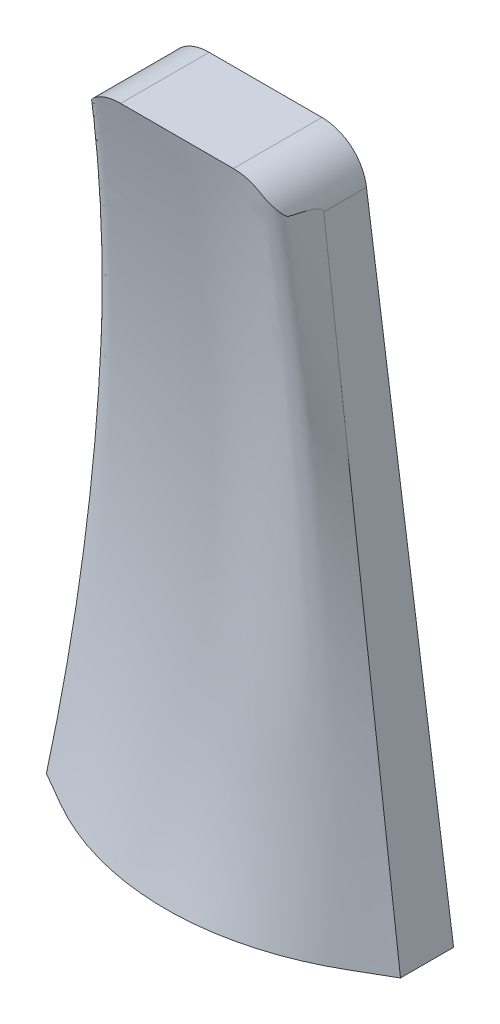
ISO-10303-21;
HEADER;
FILE_DESCRIPTION(('STEP AP214'),'2;1');
FILE_NAME('part.step','',(''),(''),'','','');
FILE_SCHEMA(('AUTOMOTIVE_DESIGN { 1 0 10303 214 1 1 1 1 }'));
ENDSEC;
DATA;
#1=APPLICATION_CONTEXT('core data for automotive mechanical design processes');
#2=APPLICATION_PROTOCOL_DEFINITION('international standard','automotive_design',2000,#1);
#3=PRODUCT_CONTEXT('',#1,'mechanical');
#4=PRODUCT('Part','Part','',(#3));
#5=PRODUCT_RELATED_PRODUCT_CATEGORY('part','',(#4));
#6=PRODUCT_DEFINITION_FORMATION('','',#4);
#7=PRODUCT_DEFINITION_CONTEXT('part definition',#1,'design');
#8=PRODUCT_DEFINITION('design','',#6,#7);
#9=PRODUCT_DEFINITION_SHAPE('','',#8);
#10=(LENGTH_UNIT() NAMED_UNIT(*) SI_UNIT(.MILLI.,.METRE.));
#11=(NAMED_UNIT(*) PLANE_ANGLE_UNIT() SI_UNIT($,.RADIAN.));
#12=(NAMED_UNIT(*) SI_UNIT($,.STERADIAN.) SOLID_ANGLE_UNIT());
#13=UNCERTAINTY_MEASURE_WITH_UNIT(LENGTH_MEASURE(1.E-05),#10,'distance_accuracy_value','');
#14=(GEOMETRIC_REPRESENTATION_CONTEXT(3) GLOBAL_UNCERTAINTY_ASSIGNED_CONTEXT((#13)) GLOBAL_UNIT_ASSIGNED_CONTEXT((#10,
#11,#12)) REPRESENTATION_CONTEXT('',''));
#15=CARTESIAN_POINT('',(0.,0.,0.));
#16=DIRECTION('',(0.,0.,1.));
#17=DIRECTION('',(1.,0.,0.));
#18=AXIS2_PLACEMENT_3D('',#15,#16,#17);
#19=CARTESIAN_POINT('',(-12.7433674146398,150.,13.2131216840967));
#20=CARTESIAN_POINT('',(-21.5839996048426,149.999999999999,13.2109239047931));
#21=CARTESIAN_POINT('',(-22.6679204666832,141.226067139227,13.2106544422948));
#22=CARTESIAN_POINT('',(-12.7430564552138,150.,11.9622779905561));
#23=CARTESIAN_POINT('',(-21.5839222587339,149.999999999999,11.9600665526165));
#24=CARTESIAN_POINT('',(-22.6676416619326,141.225806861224,11.9598117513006));
#25=CARTESIAN_POINT('',(-12.7427456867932,150.,10.711434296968));
#26=CARTESIAN_POINT('',(-21.5838450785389,150.,10.7092237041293));
#27=CARTESIAN_POINT('',(-22.6673630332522,141.225546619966,10.7089690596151));
#28=CARTESIAN_POINT('',(-12.7422798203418,150.,8.83516875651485));
#29=CARTESIAN_POINT('',(-21.5837295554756,150.,8.8329702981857));
#30=CARTESIAN_POINT('',(-22.6669453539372,141.225156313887,8.83270502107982));
#31=CARTESIAN_POINT('',(-12.7421245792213,150.,8.20974690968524));
#32=CARTESIAN_POINT('',(-21.5836910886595,150.,8.20754887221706));
#33=CARTESIAN_POINT('',(-22.6668061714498,141.225026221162,8.20728367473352));
#34=CARTESIAN_POINT('',(-12.7418141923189,150.,6.95890321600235));
#35=CARTESIAN_POINT('',(-21.5836142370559,150.,6.95670601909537));
#36=CARTESIAN_POINT('',(-22.6665278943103,141.22476605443,6.95644098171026));
#37=CARTESIAN_POINT('',(-12.7416590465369,150.,6.33348136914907));
#38=CARTESIAN_POINT('',(-21.5835758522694,150.,6.33128459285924));
#39=CARTESIAN_POINT('',(-22.6663887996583,141.224635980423,6.3310196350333));
#40=CARTESIAN_POINT('',(-12.7415039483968,150.,5.70805952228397));
#41=CARTESIAN_POINT('',(-21.58353750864,150.,5.70586678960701));
#42=CARTESIAN_POINT('',(-22.6662497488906,141.224505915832,5.70559828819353));
#43=CARTESIAN_POINT('',(-12.7412557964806,150.,4.70738456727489));
#44=CARTESIAN_POINT('',(-21.5834705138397,150.,4.70515362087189));
#45=CARTESIAN_POINT('',(-22.6660264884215,141.22430409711,4.70489118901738));
#46=CARTESIAN_POINT('',(-12.7410027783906,150.,3.7067096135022));
#47=CARTESIAN_POINT('',(-21.5834042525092,150.,3.70445805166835));
#48=CARTESIAN_POINT('',(-22.6657991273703,141.224096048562,3.70419320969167));
#49=CARTESIAN_POINT('',(-12.7404925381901,150.,1.70535970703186));
#50=CARTESIAN_POINT('',(-21.5832741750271,150.,1.70308360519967));
#51=CARTESIAN_POINT('',(-22.6653411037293,141.223672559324,1.70281550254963));
#52=CARTESIAN_POINT('',(-12.7402353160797,150.,0.70468475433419));
#53=CARTESIAN_POINT('',(-21.5832103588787,150.,0.70240406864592));
#54=CARTESIAN_POINT('',(-22.6651104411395,141.223457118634,0.702135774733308));
#55=CARTESIAN_POINT('',(-12.7398781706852,150.,-0.68830912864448));
#56=CARTESIAN_POINT('',(-21.5831239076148,150.,-0.690576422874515));
#57=CARTESIAN_POINT('',(-22.6647904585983,141.223155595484,-0.690852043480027));
#58=CARTESIAN_POINT('',(-12.7397776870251,150.,-1.08062805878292));
#59=CARTESIAN_POINT('',(-21.583099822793,150.,-1.08289262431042));
#60=CARTESIAN_POINT('',(-22.6647004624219,141.223070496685,-1.08316786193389));
#61=CARTESIAN_POINT('',(-12.7396774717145,150.,-1.47294698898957));
#62=CARTESIAN_POINT('',(-21.5830760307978,150.,-1.47520600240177));
#63=CARTESIAN_POINT('',(-22.6646107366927,141.222985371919,-1.47548227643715));
#64=CARTESIAN_POINT('',(-12.7395220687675,150.,-2.08130301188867));
#65=CARTESIAN_POINT('',(-21.5830380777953,150.,-2.08356512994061));
#66=CARTESIAN_POINT('',(-22.6644714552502,141.222854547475,-2.08383778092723));
#67=CARTESIAN_POINT('',(-12.7393667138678,150.,-2.68965903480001));
#68=CARTESIAN_POINT('',(-21.5830001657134,150.,-2.69192071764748));
#69=CARTESIAN_POINT('',(-22.6643322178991,141.222723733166,-2.69219328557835));
#70=CARTESIAN_POINT('',(-12.7381895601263,150.,-7.30071487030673));
#71=CARTESIAN_POINT('',(-21.5827131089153,150.,-7.3031232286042));
#72=CARTESIAN_POINT('',(-22.6632771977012,141.221732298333,-7.3032451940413));
#73=CARTESIAN_POINT('',(-12.7371697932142,150.,-11.3034146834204));
#74=CARTESIAN_POINT('',(-21.5824656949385,150.,-11.3058202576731));
#75=CARTESIAN_POINT('',(-22.6623632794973,141.220872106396,-11.3059416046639));
#76=CARTESIAN_POINT('',(-12.736152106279,150.,-15.3061144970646));
#77=CARTESIAN_POINT('',(-21.5822200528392,149.999999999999,-15.308363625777));
#78=CARTESIAN_POINT('',(-22.6614512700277,141.22001235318,-15.3086380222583));
#79=(BOUNDED_SURFACE() B_SPLINE_SURFACE(3,2,((#19,#20,#21),(#22,#23,#24),(#25,#26,#27),(#28,#29,
#30),(#31,#32,#33),(#34,#35,#36),(#37,#38,#39),(#40,#41,#42),(#43,#44,#45),(#46,#47,#48),(#49,
#50,#51),(#52,#53,#54),(#55,#56,#57),(#58,#59,#60),(#61,#62,#63),(#64,#65,#66),(#67,#68,#69),
(#70,#71,#72),(#73,#74,#75),(#76,#77,#78)),.UNSPECIFIED.,.F.,.F.,
.F.) B_SPLINE_SURFACE_WITH_KNOTS((4,2,2,3,2,2,3,2,4),(3,3),(0.,3.75253119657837,
5.62879679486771,7.5050623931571,10.5070873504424,13.5091123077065,14.6860691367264,
16.5111372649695,28.5192370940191),(0.,1.),
.UNSPECIFIED.) GEOMETRIC_REPRESENTATION_ITEM() RATIONAL_B_SPLINE_SURFACE(((1.,0.74920181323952,
1.),(1.,0.749193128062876,1.),(1.,0.749184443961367,1.),(1.,0.749171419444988,1.),(1.,
0.749167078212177,1.),(1.,0.749158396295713,1.),(1.,0.749154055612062,1.),(1.,0.749149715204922,
1.),(1.,0.749142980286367,1.),(1.,0.74913603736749,1.),(1.,0.749121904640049,1.),(1.,
0.749114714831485,1.),(1.,0.749104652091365,1.),(1.,0.749101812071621,1.),(1.,0.749098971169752,
1.),(1.,0.749094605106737,1.),(1.,0.749090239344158,1.),(1.,0.749057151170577,1.),(1.,
0.749028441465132,1.),(1.,0.748999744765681,1.))) REPRESENTATION_ITEM('') SURFACE());
#80=CARTESIAN_POINT('',(-22.6679204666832,141.226067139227,13.2106544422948));
#81=CARTESIAN_POINT('',(-22.6676416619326,141.225806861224,11.9598117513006));
#82=CARTESIAN_POINT('',(-22.6673630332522,141.225546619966,10.7089690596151));
#83=CARTESIAN_POINT('',(-22.6669453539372,141.225156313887,8.83270502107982));
#84=CARTESIAN_POINT('',(-22.6668061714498,141.225026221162,8.20728367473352));
#85=CARTESIAN_POINT('',(-22.6665278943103,141.22476605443,6.95644098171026));
#86=CARTESIAN_POINT('',(-22.6663887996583,141.224635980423,6.3310196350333));
#87=CARTESIAN_POINT('',(-22.6662497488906,141.224505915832,5.70559828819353));
#88=CARTESIAN_POINT('',(-22.6660264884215,141.22430409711,4.70489118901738));
#89=CARTESIAN_POINT('',(-22.6657991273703,141.224096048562,3.70419320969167));
#90=CARTESIAN_POINT('',(-22.6653411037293,141.223672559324,1.70281550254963));
#91=CARTESIAN_POINT('',(-22.6651104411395,141.223457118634,0.702135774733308));
#92=CARTESIAN_POINT('',(-22.6647904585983,141.223155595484,-0.690852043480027));
#93=CARTESIAN_POINT('',(-22.6647004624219,141.223070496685,-1.08316786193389));
#94=CARTESIAN_POINT('',(-22.6646107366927,141.222985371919,-1.47548227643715));
#95=CARTESIAN_POINT('',(-22.6644714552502,141.222854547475,-2.08383778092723));
#96=CARTESIAN_POINT('',(-22.6643322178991,141.222723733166,-2.69219328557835));
#97=CARTESIAN_POINT('',(-22.6632771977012,141.221732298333,-7.3032451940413));
#98=CARTESIAN_POINT('',(-22.6623632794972,141.220872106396,-11.3059416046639));
#99=CARTESIAN_POINT('',(-22.6614512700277,141.22001235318,-15.3086380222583));
#100=B_SPLINE_CURVE_WITH_KNOTS('',3,(#80,#81,#82,#83,#84,#85,#86,#87,#88,#89,#90,#91,#92,#93,
#94,#95,#96,#97,#98,#99),.UNSPECIFIED.,.F.,.F.,(4,2,2,3,2,2,3,2,4),(0.,3.75253119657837,
5.62879679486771,7.5050623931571,10.5070873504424,13.5091123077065,14.6860691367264,
16.5111372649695,28.5192370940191),.UNSPECIFIED.);
#101=CARTESIAN_POINT('',(-22.6662497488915,141.224505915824,5.70559828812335));
#102=VERTEX_POINT('',#101);
#103=CARTESIAN_POINT('',(-22.6646107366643,141.222985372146,-1.47548227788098));
#104=VERTEX_POINT('',#103);
#105=EDGE_CURVE('E619',#102,#104,#100,.T.);
#106=ORIENTED_EDGE('',*,*,#105,.F.);
#107=CARTESIAN_POINT('',(-12.7426905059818,150.,10.489021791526));
#108=CARTESIAN_POINT('',(-12.897593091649,150.000003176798,10.4890226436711));
#109=CARTESIAN_POINT('',(-13.052494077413,149.996400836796,10.4881769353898));
#110=CARTESIAN_POINT('',(-13.361902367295,149.982010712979,10.4848029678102));
#111=CARTESIAN_POINT('',(-13.5164097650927,149.971224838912,10.4822751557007));
#112=CARTESIAN_POINT('',(-13.824775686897,149.942488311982,10.4755463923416));
#113=CARTESIAN_POINT('',(-13.9786339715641,149.924535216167,10.4713448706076));
#114=CARTESIAN_POINT('',(-14.2853278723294,149.88150998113,10.4612845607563));
#115=CARTESIAN_POINT('',(-14.4381632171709,149.856436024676,10.4554253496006));
#116=CARTESIAN_POINT('',(-14.8605066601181,149.777031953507,10.4368867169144));
#117=CARTESIAN_POINT('',(-15.1285456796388,149.715095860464,10.4224425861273));
#118=CARTESIAN_POINT('',(-15.65838811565,149.569434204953,10.3885317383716));
#119=CARTESIAN_POINT('',(-15.9201898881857,149.485702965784,10.3690637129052));
#120=CARTESIAN_POINT('',(-16.3071019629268,149.344177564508,10.336216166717));
#121=CARTESIAN_POINT('',(-16.4352983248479,149.294259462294,10.3246389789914));
#122=CARTESIAN_POINT('',(-16.6894382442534,149.189217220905,10.3002978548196));
#123=CARTESIAN_POINT('',(-16.8153817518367,149.134092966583,10.2875338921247));
#124=CARTESIAN_POINT('',(-17.0647814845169,149.018753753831,10.2608503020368));
#125=CARTESIAN_POINT('',(-17.188237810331,148.958539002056,10.2469307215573));
#126=CARTESIAN_POINT('',(-17.4324574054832,148.83313632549,10.2179675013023));
#127=CARTESIAN_POINT('',(-17.5532208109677,148.767948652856,10.2029239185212));
#128=CARTESIAN_POINT('',(-17.766021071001,148.647364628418,10.175121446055));
#129=CARTESIAN_POINT('',(-17.858616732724,148.592903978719,10.1625730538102));
#130=CARTESIAN_POINT('',(-17.9961051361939,148.509031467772,10.1432616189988));
#131=CARTESIAN_POINT('',(-18.0417004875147,148.480710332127,10.1367429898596));
#132=CARTESIAN_POINT('',(-18.1324131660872,148.42334807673,10.1235447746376));
#133=CARTESIAN_POINT('',(-18.1775304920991,148.394306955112,10.1168651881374));
#134=CARTESIAN_POINT('',(-18.2672656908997,148.335519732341,10.103348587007));
#135=CARTESIAN_POINT('',(-18.3118836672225,148.305773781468,10.0965116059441));
#136=CARTESIAN_POINT('',(-18.4006184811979,148.245579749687,10.0826819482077));
#137=CARTESIAN_POINT('',(-18.4447353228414,148.215131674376,10.0756892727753));
#138=CARTESIAN_POINT('',(-18.5324607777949,148.153539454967,10.0615469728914));
#139=CARTESIAN_POINT('',(-18.576069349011,148.122395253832,10.0543973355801));
#140=CARTESIAN_POINT('',(-18.6410913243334,148.075164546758,10.0435653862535));
#141=CARTESIAN_POINT('',(-18.6627006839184,148.059334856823,10.0399367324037));
#142=CARTESIAN_POINT('',(-18.705786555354,148.027506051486,10.0326301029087));
#143=CARTESIAN_POINT('',(-18.7272630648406,148.011506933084,10.0289521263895));
#144=CARTESIAN_POINT('',(-18.7593328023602,147.987415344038,10.0234487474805));
#145=CARTESIAN_POINT('',(-18.7699743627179,147.979387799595,10.0216207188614));
#146=CARTESIAN_POINT('',(-18.7912149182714,147.963298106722,10.0178723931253));
#147=CARTESIAN_POINT('',(-18.8018139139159,147.95523595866,10.0159520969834));
#148=CARTESIAN_POINT('',(-18.8335436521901,147.931000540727,10.0100376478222));
#149=CARTESIAN_POINT('',(-18.8546080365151,147.914777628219,10.0058897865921));
#150=CARTESIAN_POINT('',(-18.8965540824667,147.882205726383,9.9972072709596));
#151=CARTESIAN_POINT('',(-18.9174357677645,147.86585675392,9.9926726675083));
#152=CARTESIAN_POINT('',(-18.9590165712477,147.833034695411,9.98322624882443));
#153=CARTESIAN_POINT('',(-18.9797156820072,147.816561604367,9.97831441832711));
#154=CARTESIAN_POINT('',(-19.0415166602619,147.766977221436,9.96303702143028));
#155=CARTESIAN_POINT('',(-19.0823409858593,147.73368620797,9.95212563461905));
#156=CARTESIAN_POINT('',(-19.1632336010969,147.666655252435,9.92893901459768));
#157=CARTESIAN_POINT('',(-19.2033017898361,147.632915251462,9.91666360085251));
#158=CARTESIAN_POINT('',(-19.2826276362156,147.565051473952,9.89084882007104));
#159=CARTESIAN_POINT('',(-19.3218860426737,147.53092810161,9.87731069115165));
#160=CARTESIAN_POINT('',(-19.3996211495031,147.462295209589,9.84904138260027));
#161=CARTESIAN_POINT('',(-19.4380978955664,147.427785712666,9.83431027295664));
#162=CARTESIAN_POINT('',(-19.5523848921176,147.323682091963,9.78842508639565));
#163=CARTESIAN_POINT('',(-19.6270248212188,147.253536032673,9.7555880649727));
#164=CARTESIAN_POINT('',(-19.7732041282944,147.111922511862,9.68594323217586));
#165=CARTESIAN_POINT('',(-19.8447417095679,147.040454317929,9.64913316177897));
#166=CARTESIAN_POINT('',(-19.9846887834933,146.896393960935,9.57200242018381));
#167=CARTESIAN_POINT('',(-20.0530988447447,146.823802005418,9.53168239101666));
#168=CARTESIAN_POINT('',(-20.1869239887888,146.677528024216,9.4478878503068));
#169=CARTESIAN_POINT('',(-20.2523359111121,146.603844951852,9.40441012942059));
#170=CARTESIAN_POINT('',(-20.3801639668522,146.455550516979,9.31472083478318));
#171=CARTESIAN_POINT('',(-20.4425798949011,146.380939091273,9.26850907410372));
#172=CARTESIAN_POINT('',(-20.6262262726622,146.154868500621,9.12565879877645));
#173=CARTESIAN_POINT('',(-20.743012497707,146.002097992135,9.02534248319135));
#174=CARTESIAN_POINT('',(-20.9652703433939,145.693722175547,8.81713951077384));
#175=CARTESIAN_POINT('',(-21.0707468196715,145.538118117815,8.70925613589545));
#176=CARTESIAN_POINT('',(-21.2568109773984,145.246606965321,8.50308315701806));
#177=CARTESIAN_POINT('',(-21.3388086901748,145.111027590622,8.40559549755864));
#178=CARTESIAN_POINT('',(-21.495256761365,144.838120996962,8.20703708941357));
#179=CARTESIAN_POINT('',(-21.5697059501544,144.700793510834,8.10596578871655));
#180=CARTESIAN_POINT('',(-21.7114024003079,144.424346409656,7.90090994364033));
#181=CARTESIAN_POINT('',(-21.7786417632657,144.285225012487,7.79692235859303));
#182=CARTESIAN_POINT('',(-21.906049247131,144.005407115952,7.58680248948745));
#183=CARTESIAN_POINT('',(-21.9662181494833,143.864710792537,7.48067044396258));
#184=CARTESIAN_POINT('',(-22.0799144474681,143.581167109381,7.2663054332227));
#185=CARTESIAN_POINT('',(-22.1334114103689,143.438313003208,7.15806527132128));
#186=CARTESIAN_POINT('',(-22.2336515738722,143.150891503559,6.94065927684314));
#187=CARTESIAN_POINT('',(-22.2803929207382,143.006323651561,6.83149319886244));
#188=CARTESIAN_POINT('',(-22.3672098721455,142.715355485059,6.61341612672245));
#189=CARTESIAN_POINT('',(-22.4072955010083,142.568958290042,6.50450499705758));
#190=CARTESIAN_POINT('',(-22.4626142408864,142.347101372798,6.34272633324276));
#191=CARTESIAN_POINT('',(-22.4802481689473,142.27279219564,6.2890787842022));
#192=CARTESIAN_POINT('',(-22.5139598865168,142.123036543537,6.18289712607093));
#193=CARTESIAN_POINT('',(-22.5300383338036,142.047590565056,6.13036255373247));
#194=CARTESIAN_POINT('',(-22.5650605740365,141.873317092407,6.0127618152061));
#195=CARTESIAN_POINT('',(-22.5835127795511,141.773960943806,5.94839745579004));
#196=CARTESIAN_POINT('',(-22.618131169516,141.56953503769,5.83041317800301));
#197=CARTESIAN_POINT('',(-22.6343287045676,141.46457951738,5.77664039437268));
#198=CARTESIAN_POINT('',(-22.6523572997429,141.332497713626,5.7326688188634));
#199=CARTESIAN_POINT('',(-22.6551911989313,141.311243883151,5.72626891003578));
#200=CARTESIAN_POINT('',(-22.6607852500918,141.268218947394,5.71483605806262));
#201=CARTESIAN_POINT('',(-22.663544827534,141.246445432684,5.7098119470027));
#202=CARTESIAN_POINT('',(-22.6662497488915,141.224505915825,5.70559828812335));
#203=B_SPLINE_CURVE_WITH_KNOTS('',3,(#107,#108,#109,#110,#111,#112,#113,#114,#115,#116,#117,
#118,#119,#120,#121,#122,#123,#124,#125,#126,#127,#128,#129,#130,#131,#132,#133,#134,#135,#136,
#137,#138,#139,#140,#141,#142,#143,#144,#145,#146,#147,#148,#149,#150,#151,#152,#153,#154,#155,
#156,#157,#158,#159,#160,#161,#162,#163,#164,#165,#166,#167,#168,#169,#170,#171,#172,#173,#174,
#175,#176,#177,#178,#179,#180,#181,#182,#183,#184,#185,#186,#187,#188,#189,#190,#191,#192,#193,
#194,#195,#196,#197,#198,#199,#200,#201,#202),.UNSPECIFIED.,.F.,.F.,(4,2,2,2,2,2,2,2,2,2,2,2,2,
2,2,2,2,2,2,2,2,2,2,2,2,2,2,2,2,2,2,2,2,2,2,2,2,2,2,2,2,2,2,2,2,2,2,4),(0.,0.464660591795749,
0.929197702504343,1.39389328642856,1.85870756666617,2.68411495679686,3.50973754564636,
3.92381178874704,4.33789519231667,4.75196179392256,5.16600741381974,5.49041147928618,
5.65261398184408,5.81481690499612,5.97698554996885,6.13915290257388,6.30133359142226,
6.3824278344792,6.46352351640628,6.50388709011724,6.54425023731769,6.62497316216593,
6.70568546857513,6.78640104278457,6.94775980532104,7.10913994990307,7.27036348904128,
7.43157757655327,7.75411586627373,8.07683852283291,8.39950227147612,8.72249867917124,
9.04551719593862,9.69562947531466,10.3454615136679,10.9033610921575,11.461346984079,
12.0199380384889,12.5784672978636,13.1394576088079,13.70060156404,14.2608925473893,
14.5408897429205,14.8207680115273,15.1805109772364,15.5346042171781,15.6016792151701,
15.6691752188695),.UNSPECIFIED.);
#204=CARTESIAN_POINT('',(-12.7426905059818,150.,10.489021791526));
#205=VERTEX_POINT('',#204);
#206=EDGE_CURVE('E13',#205,#102,#203,.T.);
#207=ORIENTED_EDGE('',*,*,#206,.F.);
#208=CARTESIAN_POINT('',(-12.736152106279,150.,-15.3061144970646));
#209=CARTESIAN_POINT('',(-12.7371697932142,150.,-11.3034146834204));
#210=CARTESIAN_POINT('',(-12.7381895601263,150.,-7.30071487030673));
#211=CARTESIAN_POINT('',(-12.7393667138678,150.,-2.68965903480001));
#212=CARTESIAN_POINT('',(-12.7395220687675,150.,-2.08130301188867));
#213=CARTESIAN_POINT('',(-12.7396774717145,150.,-1.47294698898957));
#214=CARTESIAN_POINT('',(-12.7397776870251,150.,-1.08062805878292));
#215=CARTESIAN_POINT('',(-12.7398781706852,150.,-0.688309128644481));
#216=CARTESIAN_POINT('',(-12.7402353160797,150.,0.704684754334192));
#217=CARTESIAN_POINT('',(-12.7404925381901,150.,1.70535970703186));
#218=CARTESIAN_POINT('',(-12.7410027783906,150.,3.7067096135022));
#219=CARTESIAN_POINT('',(-12.7412557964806,150.,4.70738456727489));
#220=CARTESIAN_POINT('',(-12.7415039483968,150.,5.70805952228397));
#221=CARTESIAN_POINT('',(-12.7416590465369,150.,6.33348136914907));
#222=CARTESIAN_POINT('',(-12.7418141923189,150.,6.95890321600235));
#223=CARTESIAN_POINT('',(-12.7421245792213,150.,8.20974690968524));
#224=CARTESIAN_POINT('',(-12.7422798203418,150.,8.83516875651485));
#225=CARTESIAN_POINT('',(-12.7427456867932,150.,10.711434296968));
#226=CARTESIAN_POINT('',(-12.7430564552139,150.,11.9622779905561));
#227=CARTESIAN_POINT('',(-12.7433674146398,150.,13.2131216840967));
#228=B_SPLINE_CURVE_WITH_KNOTS('',3,(#208,#209,#210,#211,#212,#213,#214,#215,#216,#217,#218,
#219,#220,#221,#222,#223,#224,#225,#226,#227),.UNSPECIFIED.,.F.,.F.,(4,2,3,2,2,3,2,2,4),(0.,
12.0080998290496,13.8331679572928,15.0101247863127,18.0121497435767,21.014174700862,
22.8904402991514,24.7667058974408,28.5192370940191),.UNSPECIFIED.);
#229=CARTESIAN_POINT('',(-12.7376269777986,150.,-9.51097820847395));
#230=VERTEX_POINT('',#229);
#231=EDGE_CURVE('E349',#230,#205,#228,.T.);
#232=ORIENTED_EDGE('',*,*,#231,.F.);
#233=CARTESIAN_POINT('',(-21.7553885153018,144.321654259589,-10.2263766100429));
#234=CARTESIAN_POINT('',(-21.6342456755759,144.574524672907,-10.1920589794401));
#235=CARTESIAN_POINT('',(-21.5023812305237,144.822351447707,-10.158420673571));
#236=CARTESIAN_POINT('',(-21.2181927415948,145.306229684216,-10.0928945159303));
#237=CARTESIAN_POINT('',(-21.0658684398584,145.542280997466,-10.0610066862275));
#238=CARTESIAN_POINT('',(-20.741749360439,146.000910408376,-9.99937462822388));
#239=CARTESIAN_POINT('',(-20.5699548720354,146.223488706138,-9.96963036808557));
#240=CARTESIAN_POINT('',(-20.2080684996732,146.653566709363,-9.91260200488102));
#241=CARTESIAN_POINT('',(-20.0179771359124,146.861066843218,-9.88531783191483));
#242=CARTESIAN_POINT('',(-19.6206490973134,147.259622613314,-9.83344114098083));
#243=CARTESIAN_POINT('',(-19.4133999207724,147.450666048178,-9.80885061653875));
#244=CARTESIAN_POINT('',(-18.9833248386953,147.814719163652,-9.76256333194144));
#245=CARTESIAN_POINT('',(-18.7604990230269,147.987728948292,-9.74086655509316));
#246=CARTESIAN_POINT('',(-18.3009734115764,148.314328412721,-9.70048467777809));
#247=CARTESIAN_POINT('',(-18.0642814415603,148.467928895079,-9.68179790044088));
#248=CARTESIAN_POINT('',(-17.5786029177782,148.754664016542,-9.64745892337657));
#249=CARTESIAN_POINT('',(-17.3296165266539,148.887798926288,-9.63180668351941));
#250=CARTESIAN_POINT('',(-16.8230140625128,149.131696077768,-9.60361504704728));
#251=CARTESIAN_POINT('',(-16.5654750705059,149.242615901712,-9.59105356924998));
#252=CARTESIAN_POINT('',(-16.0418826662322,149.442474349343,-9.5688163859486));
#253=CARTESIAN_POINT('',(-15.7758292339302,149.531412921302,-9.55914068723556));
#254=CARTESIAN_POINT('',(-15.2369881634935,149.686681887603,-9.54254954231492));
#255=CARTESIAN_POINT('',(-14.9641974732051,149.753001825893,-9.53563537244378));
#256=CARTESIAN_POINT('',(-14.4139555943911,149.862484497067,-9.52441955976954));
#257=CARTESIAN_POINT('',(-14.1365044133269,149.905647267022,-9.52011791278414));
#258=CARTESIAN_POINT('',(-13.5800175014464,149.96837360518,-9.51396342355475));
#259=CARTESIAN_POINT('',(-13.3009921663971,149.988028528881,-9.51210109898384));
#260=CARTESIAN_POINT('',(-12.7422659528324,150.003904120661,-9.51060960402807));
#261=CARTESIAN_POINT('',(-12.4625650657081,150.000124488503,-9.51098046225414));
#262=CARTESIAN_POINT('',(-11.9043915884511,149.969143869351,-9.513768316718));
#263=CARTESIAN_POINT('',(-11.625919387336,149.941935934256,-9.51618591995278));
#264=CARTESIAN_POINT('',(-11.0722402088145,149.864319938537,-9.52288958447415));
#265=CARTESIAN_POINT('',(-10.797033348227,149.813911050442,-9.52717571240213));
#266=CARTESIAN_POINT('',(-10.5244458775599,149.752017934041,-9.53230676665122));
#267=B_SPLINE_CURVE_WITH_KNOTS('',3,(#233,#234,#235,#236,#237,#238,#239,#240,#241,#242,#243,
#244,#245,#246,#247,#248,#249,#250,#251,#252,#253,#254,#255,#256,#257,#258,#259,#260,#261,#262,
#263,#264,#265,#266),.UNSPECIFIED.,.F.,.F.,(4,2,2,2,2,2,2,2,2,2,2,2,2,2,2,2,4),(0.,
0.84720434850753,1.69441937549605,2.54162181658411,3.38880017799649,4.23660134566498,
5.08439762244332,5.93171994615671,6.77903106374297,7.62010052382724,8.4611719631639,
9.30263168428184,10.1440900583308,10.9822676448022,11.8204559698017,12.6588929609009,
13.4973598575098),.UNSPECIFIED.);
#268=CARTESIAN_POINT('',(-21.755388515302,144.321654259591,-10.2263766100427));
#269=VERTEX_POINT('',#268);
#270=EDGE_CURVE('E648',#269,#230,#267,.T.);
#271=ORIENTED_EDGE('',*,*,#270,.F.);
#272=CARTESIAN_POINT('',(-22.6646107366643,141.222985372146,-1.47548227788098));
#273=CARTESIAN_POINT('',(-22.6588490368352,141.269883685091,-1.46667308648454));
#274=CARTESIAN_POINT('',(-22.6526290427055,141.317515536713,-1.46182279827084));
#275=CARTESIAN_POINT('',(-22.6395306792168,141.412509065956,-1.46028155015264));
#276=CARTESIAN_POINT('',(-22.6326566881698,141.459870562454,-1.46353955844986));
#277=CARTESIAN_POINT('',(-22.618413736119,141.553322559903,-1.47835792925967));
#278=CARTESIAN_POINT('',(-22.6110436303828,141.599409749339,-1.48993813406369));
#279=CARTESIAN_POINT('',(-22.5960980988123,141.689025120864,-1.52045163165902));
#280=CARTESIAN_POINT('',(-22.5885224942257,141.732550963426,-1.53939153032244));
#281=CARTESIAN_POINT('',(-22.5699969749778,141.835222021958,-1.59304365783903));
#282=CARTESIAN_POINT('',(-22.5590532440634,141.892646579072,-1.63102147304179));
#283=CARTESIAN_POINT('',(-22.5375332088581,142.000968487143,-1.71547292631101));
#284=CARTESIAN_POINT('',(-22.526958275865,142.051843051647,-1.76197492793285));
#285=CARTESIAN_POINT('',(-22.4968100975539,142.192076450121,-1.90570190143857));
#286=CARTESIAN_POINT('',(-22.4778882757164,142.273889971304,-2.01030179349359));
#287=CARTESIAN_POINT('',(-22.4416879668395,142.42344684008,-2.22921353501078));
#288=CARTESIAN_POINT('',(-22.4244150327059,142.491143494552,-2.34355590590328));
#289=CARTESIAN_POINT('',(-22.3924299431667,142.612002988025,-2.5689957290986));
#290=CARTESIAN_POINT('',(-22.3776228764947,142.665870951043,-2.67970616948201));
#291=CARTESIAN_POINT('',(-22.3489394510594,142.767277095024,-2.90413247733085));
#292=CARTESIAN_POINT('',(-22.3350636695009,142.814811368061,-3.01785014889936));
#293=CARTESIAN_POINT('',(-22.2945329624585,142.950343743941,-3.3624516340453));
#294=CARTESIAN_POINT('',(-22.2690370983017,143.031043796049,-3.59632397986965));
#295=CARTESIAN_POINT('',(-22.2201889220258,143.180156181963,-4.06907037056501));
#296=CARTESIAN_POINT('',(-22.1968458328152,143.248516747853,-4.30796099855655));
#297=CARTESIAN_POINT('',(-22.1519299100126,143.376113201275,-4.78799363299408));
#298=CARTESIAN_POINT('',(-22.1303549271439,143.435360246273,-5.02913249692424));
#299=CARTESIAN_POINT('',(-22.0889363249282,143.546198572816,-5.5091951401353));
#300=CARTESIAN_POINT('',(-22.0690705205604,143.597897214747,-5.74809259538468));
#301=CARTESIAN_POINT('',(-22.0304601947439,143.696158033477,-6.22710004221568));
#302=CARTESIAN_POINT('',(-22.0117160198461,143.742718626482,-6.4672103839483));
#303=CARTESIAN_POINT('',(-21.9570560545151,143.875860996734,-7.18692738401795));
#304=CARTESIAN_POINT('',(-21.9225563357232,143.956312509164,-7.66777308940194));
#305=CARTESIAN_POINT('',(-21.8564554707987,144.105813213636,-8.63104976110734));
#306=CARTESIAN_POINT('',(-21.8248524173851,144.174869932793,-9.1134794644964));
#307=CARTESIAN_POINT('',(-21.7638773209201,144.304541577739,-10.0812910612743));
#308=CARTESIAN_POINT('',(-21.7345131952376,144.365127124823,-10.5666774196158));
#309=CARTESIAN_POINT('',(-21.7060519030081,144.422704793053,-11.0524304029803));
#310=B_SPLINE_CURVE_WITH_KNOTS('',3,(#272,#273,#274,#275,#276,#277,#278,#279,#280,#281,#282,
#283,#284,#285,#286,#287,#288,#289,#290,#291,#292,#293,#294,#295,#296,#297,#298,#299,#300,#301,
#302,#303,#304,#305,#306,#307,#308,#309),.UNSPECIFIED.,.F.,.F.,(4,2,2,2,2,2,2,2,2,2,2,2,2,2,2,2,
2,2,4),(0.,0.144106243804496,0.287307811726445,0.43085194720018,0.574525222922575,
0.782455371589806,0.991090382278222,1.39125482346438,1.79272256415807,2.1644524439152,
2.53641063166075,3.28187184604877,4.03039127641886,4.7779868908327,5.51361637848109,
6.24947199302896,7.71547450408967,9.18050469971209,10.6504959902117),.UNSPECIFIED.);
#311=EDGE_CURVE('E641',#104,#269,#310,.T.);
#312=ORIENTED_EDGE('',*,*,#311,.F.);
#313=EDGE_LOOP('',(#106,#207,#232,#271,#312));
#314=FACE_BOUND('',#313,.T.);
#315=ADVANCED_FACE('F335',(#314),#79,.T.);
#316=CARTESIAN_POINT('',(12.7350632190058,140.,0.));
#317=DIRECTION('',(0.,0.,1.));
#318=DIRECTION('',(1.,0.,0.));
#319=AXIS2_PLACEMENT_3D('',#316,#317,#318);
#320=CYLINDRICAL_SURFACE('',#319,10.);
#321=DIRECTION('',(0.,0.,1.));
#322=VECTOR('',#321,1.);
#323=CARTESIAN_POINT('',(22.6605247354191,141.218693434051,0.));
#324=LINE('',#323,#322);
#325=CARTESIAN_POINT('',(22.6605247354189,141.218693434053,-9.65669063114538));
#326=VERTEX_POINT('',#325);
#327=CARTESIAN_POINT('',(22.660524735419,141.218693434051,0.));
#328=VERTEX_POINT('',#327);
#329=EDGE_CURVE('E431',#326,#328,#324,.T.);
#330=ORIENTED_EDGE('',*,*,#329,.F.);
#331=CARTESIAN_POINT('',(13.3903225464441,149.978508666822,-9.5124810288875));
#332=CARTESIAN_POINT('',(13.6003549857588,149.964725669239,-9.51341711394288));
#333=CARTESIAN_POINT('',(13.8099459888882,149.944293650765,-9.51475919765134));
#334=CARTESIAN_POINT('',(14.2273782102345,149.890259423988,-9.51809560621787));
#335=CARTESIAN_POINT('',(14.4352197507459,149.856659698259,-9.52008980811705));
#336=CARTESIAN_POINT('',(14.8485877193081,149.776369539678,-9.52457357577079));
#337=CARTESIAN_POINT('',(15.0541114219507,149.729665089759,-9.52706367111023));
#338=CARTESIAN_POINT('',(15.4617972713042,149.623372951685,-9.53238771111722));
#339=CARTESIAN_POINT('',(15.6639592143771,149.563784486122,-9.53522167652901));
#340=CARTESIAN_POINT('',(16.1310093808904,149.409916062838,-9.54207503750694));
#341=CARTESIAN_POINT('',(16.394286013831,149.310697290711,-9.54617412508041));
#342=CARTESIAN_POINT('',(16.91157324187,149.090424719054,-9.55444314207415));
#343=CARTESIAN_POINT('',(17.165582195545,148.969367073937,-9.55861308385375));
#344=CARTESIAN_POINT('',(17.6625787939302,148.706242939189,-9.56678747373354));
#345=CARTESIAN_POINT('',(17.9055632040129,148.564170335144,-9.570791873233));
#346=CARTESIAN_POINT('',(18.3786955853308,148.260054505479,-9.57845834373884));
#347=CARTESIAN_POINT('',(18.6088437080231,148.098011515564,-9.5821204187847));
#348=CARTESIAN_POINT('',(19.05464018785,147.755128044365,-9.5889939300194));
#349=CARTESIAN_POINT('',(19.2702905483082,147.574290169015,-9.59220542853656));
#350=CARTESIAN_POINT('',(19.6855935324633,147.195081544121,-9.59814051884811));
#351=CARTESIAN_POINT('',(19.8852459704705,146.996710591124,-9.60086410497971));
#352=CARTESIAN_POINT('',(20.2671024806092,146.583876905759,-9.6058550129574));
#353=CARTESIAN_POINT('',(20.4493089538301,146.369416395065,-9.60812239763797));
#354=CARTESIAN_POINT('',(20.7950067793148,145.925905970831,-9.61230060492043));
#355=CARTESIAN_POINT('',(20.9584982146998,145.696856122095,-9.61421142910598));
#356=CARTESIAN_POINT('',(21.2655660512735,145.225852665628,-9.61783743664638));
#357=CARTESIAN_POINT('',(21.409147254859,144.983902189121,-9.61955266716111));
#358=CARTESIAN_POINT('',(21.6754208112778,144.488766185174,-9.62300399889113));
#359=CARTESIAN_POINT('',(21.7981130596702,144.235580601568,-9.62474010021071));
#360=CARTESIAN_POINT('',(22.0217513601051,143.719739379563,-9.62849495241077));
#361=CARTESIAN_POINT('',(22.1226942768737,143.457082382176,-9.63051374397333));
#362=CARTESIAN_POINT('',(22.3020937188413,142.924203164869,-9.6351301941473));
#363=CARTESIAN_POINT('',(22.3805502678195,142.653980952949,-9.63772785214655));
#364=CARTESIAN_POINT('',(22.5143892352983,142.108018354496,-9.64382016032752));
#365=CARTESIAN_POINT('',(22.5697818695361,141.832280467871,-9.64731441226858));
#366=CARTESIAN_POINT('',(22.6571544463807,141.277134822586,-9.65552925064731));
#367=CARTESIAN_POINT('',(22.6891341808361,140.997727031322,-9.66024984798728));
#368=CARTESIAN_POINT('',(22.7294642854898,140.437007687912,-9.67124997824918));
#369=CARTESIAN_POINT('',(22.7377949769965,140.155694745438,-9.67753080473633));
#370=CARTESIAN_POINT('',(22.7307575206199,139.593396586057,-9.69195535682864));
#371=CARTESIAN_POINT('',(22.7153878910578,139.31241139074,-9.7000991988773));
#372=CARTESIAN_POINT('',(22.6881609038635,139.032608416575,-9.70932715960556));
#373=B_SPLINE_CURVE_WITH_KNOTS('',3,(#331,#332,#333,#334,#335,#336,#337,#338,#339,#340,#341,
#342,#343,#344,#345,#346,#347,#348,#349,#350,#351,#352,#353,#354,#355,#356,#357,#358,#359,#360,
#361,#362,#363,#364,#365,#366,#367,#368,#369,#370,#371,#372),.UNSPECIFIED.,.F.,.F.,(4,2,2,2,2,2,
2,2,2,2,2,2,2,2,2,2,2,2,2,2,4),(0.,0.631348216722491,1.26257745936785,1.89448446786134,
2.52642961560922,3.3695299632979,4.21277891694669,5.05627370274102,5.89975853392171,
6.74312657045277,7.58650439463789,8.42976597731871,9.27302381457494,10.1160779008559,
10.9591362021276,11.8023159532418,12.6454948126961,13.4882998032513,14.3311122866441,
15.1746258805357,16.0181922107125),.UNSPECIFIED.);
#374=CARTESIAN_POINT('',(13.3903225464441,149.978508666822,-9.5124810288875));
#375=VERTEX_POINT('',#374);
#376=EDGE_CURVE('E692',#375,#326,#373,.T.);
#377=ORIENTED_EDGE('',*,*,#376,.F.);
#378=CARTESIAN_POINT('',(12.7350632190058,150.,-9.51097820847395));
#379=CARTESIAN_POINT('',(12.8480821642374,150.000000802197,-9.51097815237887));
#380=CARTESIAN_POINT('',(12.9611010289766,149.99808403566,-9.51111218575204));
#381=CARTESIAN_POINT('',(13.1864964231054,149.990438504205,-9.5116468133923));
#382=CARTESIAN_POINT('',(13.298873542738,149.984727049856,-9.51204619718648));
#383=CARTESIAN_POINT('',(13.522989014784,149.969540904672,-9.51310811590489));
#384=CARTESIAN_POINT('',(13.6347282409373,149.960079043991,-9.5137697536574));
#385=CARTESIAN_POINT('',(13.8575707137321,149.937428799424,-9.51535361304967));
#386=CARTESIAN_POINT('',(13.9686748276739,149.924248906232,-9.51627524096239));
#387=CARTESIAN_POINT('',(14.1902490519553,149.894186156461,-9.51837743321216));
#388=CARTESIAN_POINT('',(14.3007197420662,149.877307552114,-9.51955770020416));
#389=CARTESIAN_POINT('',(14.5210302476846,149.839858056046,-9.52217642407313));
#390=CARTESIAN_POINT('',(14.6308700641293,149.819287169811,-9.52361488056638));
#391=CARTESIAN_POINT('',(14.8499205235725,149.774450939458,-9.5267501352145));
#392=CARTESIAN_POINT('',(14.9591303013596,149.750181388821,-9.52844722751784));
#393=CARTESIAN_POINT('',(15.1769171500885,149.69793371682,-9.53210074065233));
#394=CARTESIAN_POINT('',(15.2854922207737,149.669947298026,-9.53405774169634));
#395=CARTESIAN_POINT('',(15.5020031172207,149.610239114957,-9.53823294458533));
#396=CARTESIAN_POINT('',(15.6099355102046,149.57850496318,-9.54045201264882));
#397=CARTESIAN_POINT('',(15.8251519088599,149.511262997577,-9.54515402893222));
#398=CARTESIAN_POINT('',(15.9324307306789,149.475738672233,-9.54763813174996));
#399=CARTESIAN_POINT('',(16.0390736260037,149.438406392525,-9.55024865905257));
#400=B_SPLINE_CURVE_WITH_KNOTS('',3,(#378,#379,#380,#381,#382,#383,#384,#385,#386,#387,#388,
#389,#390,#391,#392,#393,#394,#395,#396,#397,#398,#399),.UNSPECIFIED.,.F.,.F.,(4,2,2,2,2,2,2,2,
2,2,4),(0.,0.339040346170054,0.676544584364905,1.01290404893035,1.34850151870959,
1.68371517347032,2.01892833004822,2.35452561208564,2.69088507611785,3.02838919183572,
3.36742878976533),.UNSPECIFIED.);
#401=CARTESIAN_POINT('',(12.7350632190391,150.,-9.51097820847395));
#402=VERTEX_POINT('',#401);
#403=EDGE_CURVE('E526',#402,#375,#400,.T.);
#404=ORIENTED_EDGE('',*,*,#403,.F.);
#405=DIRECTION('',(0.,0.,1.));
#406=VECTOR('',#405,1.);
#407=CARTESIAN_POINT('',(12.7350632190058,150.,7.48902179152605));
#408=LINE('',#407,#406);
#409=CARTESIAN_POINT('',(12.7350632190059,150.,10.4890217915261));
#410=VERTEX_POINT('',#409);
#411=EDGE_CURVE('E709',#410,#402,#408,.F.);
#412=ORIENTED_EDGE('',*,*,#411,.F.);
#413=CARTESIAN_POINT('',(22.660524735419,141.218693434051,0.));
#414=CARTESIAN_POINT('',(22.6581934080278,141.237685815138,-1.03669654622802E-05));
#415=CARTESIAN_POINT('',(22.6558065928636,141.256669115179,0.000877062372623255));
#416=CARTESIAN_POINT('',(22.6509484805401,141.294441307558,0.00440528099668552));
#417=CARTESIAN_POINT('',(22.648477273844,141.313230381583,0.00704424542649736));
#418=CARTESIAN_POINT('',(22.6435043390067,141.350236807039,0.0139881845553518));
#419=CARTESIAN_POINT('',(22.6410034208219,141.368458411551,0.0182711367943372));
#420=CARTESIAN_POINT('',(22.6359639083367,141.404455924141,0.0283985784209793));
#421=CARTESIAN_POINT('',(22.6334253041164,141.422231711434,0.0342434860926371));
#422=CARTESIAN_POINT('',(22.6246457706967,141.482574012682,0.0568743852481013));
#423=CARTESIAN_POINT('',(22.6183599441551,141.523815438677,0.0772588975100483));
#424=CARTESIAN_POINT('',(22.6058992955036,141.602562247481,0.124487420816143));
#425=CARTESIAN_POINT('',(22.5997252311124,141.6400468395,0.151364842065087));
#426=CARTESIAN_POINT('',(22.5884832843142,141.70618497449,0.205406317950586));
#427=CARTESIAN_POINT('',(22.5833841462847,141.735332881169,0.231971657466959));
#428=CARTESIAN_POINT('',(22.5733686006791,141.791244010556,0.287554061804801));
#429=CARTESIAN_POINT('',(22.568452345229,141.818005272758,0.316573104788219));
#430=CARTESIAN_POINT('',(22.558796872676,141.869476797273,0.376473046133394));
#431=CARTESIAN_POINT('',(22.554057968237,141.894183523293,0.407357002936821));
#432=CARTESIAN_POINT('',(22.5447571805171,141.941775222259,0.470494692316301));
#433=CARTESIAN_POINT('',(22.5401952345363,141.964660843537,0.502747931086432));
#434=CARTESIAN_POINT('',(22.52858839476,142.021918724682,0.587666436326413));
#435=CARTESIAN_POINT('',(22.5216664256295,142.055102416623,0.641148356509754));
#436=CARTESIAN_POINT('',(22.5081736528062,142.118337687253,0.749988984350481));
#437=CARTESIAN_POINT('',(22.5016030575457,142.148387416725,0.805348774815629));
#438=CARTESIAN_POINT('',(22.4887563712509,142.205978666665,0.917515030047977));
#439=CARTESIAN_POINT('',(22.4824808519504,142.233515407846,0.974323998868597));
#440=CARTESIAN_POINT('',(22.470196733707,142.286462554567,1.08895693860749));
#441=CARTESIAN_POINT('',(22.464188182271,142.311872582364,1.14678108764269));
#442=CARTESIAN_POINT('',(22.4464472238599,142.385709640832,1.32204739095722));
#443=CARTESIAN_POINT('',(22.4350691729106,142.43143603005,1.44066268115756));
#444=CARTESIAN_POINT('',(22.4130649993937,142.517585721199,1.67967085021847));
#445=CARTESIAN_POINT('',(22.402438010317,142.558015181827,1.80006148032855));
#446=CARTESIAN_POINT('',(22.3790695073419,142.644933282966,2.07385682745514));
#447=CARTESIAN_POINT('',(22.366503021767,142.690236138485,2.22765101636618));
#448=CARTESIAN_POINT('',(22.3420967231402,142.776128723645,2.53669672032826));
#449=CARTESIAN_POINT('',(22.3302573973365,142.81671530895,2.69194913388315));
#450=CARTESIAN_POINT('',(22.307158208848,142.894241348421,3.0035039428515));
#451=CARTESIAN_POINT('',(22.2958987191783,142.931178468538,3.15980694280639));
#452=CARTESIAN_POINT('',(22.2738522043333,143.002146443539,3.47312331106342));
#453=CARTESIAN_POINT('',(22.2630652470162,143.03617688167,3.63013677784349));
#454=CARTESIAN_POINT('',(22.2418651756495,143.101920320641,3.94483601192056));
#455=CARTESIAN_POINT('',(22.2314524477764,143.133630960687,4.10252229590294));
#456=CARTESIAN_POINT('',(22.2109436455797,143.195111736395,4.41821161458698));
#457=CARTESIAN_POINT('',(22.2008474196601,143.224882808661,4.57621445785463));
#458=CARTESIAN_POINT('',(22.180910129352,143.282820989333,4.89243401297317));
#459=CARTESIAN_POINT('',(22.1710689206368,143.310989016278,5.05065054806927));
#460=CARTESIAN_POINT('',(22.1515892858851,143.365989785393,5.3672074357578));
#461=CARTESIAN_POINT('',(22.1419507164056,143.392823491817,5.52554761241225));
#462=CARTESIAN_POINT('',(22.1283051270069,143.430327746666,5.75157151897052));
#463=CARTESIAN_POINT('',(22.1242379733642,143.441443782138,5.81917812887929));
#464=CARTESIAN_POINT('',(22.1161248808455,143.463498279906,5.9544556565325));
#465=CARTESIAN_POINT('',(22.1120789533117,143.474436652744,6.02212658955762));
#466=CARTESIAN_POINT('',(22.1040008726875,143.496160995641,6.15759727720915));
#467=CARTESIAN_POINT('',(22.0999687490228,143.506946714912,6.22539707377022));
#468=CARTESIAN_POINT('',(22.0919110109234,143.528389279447,6.36119035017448));
#469=CARTESIAN_POINT('',(22.0878854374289,143.53904573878,6.42918389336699));
#470=CARTESIAN_POINT('',(22.0799147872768,143.560038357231,6.56405685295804));
#471=CARTESIAN_POINT('',(22.0759694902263,143.570376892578,6.63093588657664));
#472=CARTESIAN_POINT('',(22.0700599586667,143.585786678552,6.73125168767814));
#473=CARTESIAN_POINT('',(22.0680920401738,143.59090558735,6.76468092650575));
#474=CARTESIAN_POINT('',(22.0641588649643,143.60111154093,6.83153410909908));
#475=CARTESIAN_POINT('',(22.0621936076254,143.606198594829,6.86495805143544));
#476=CARTESIAN_POINT('',(22.0582746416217,143.616318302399,6.9316434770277));
#477=CARTESIAN_POINT('',(22.0563209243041,143.621351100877,6.96490493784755));
#478=CARTESIAN_POINT('',(22.0533902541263,143.628882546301,7.01481746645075));
#479=CARTESIAN_POINT('',(22.0524128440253,143.631391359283,7.03146696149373));
#480=CARTESIAN_POINT('',(22.0504583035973,143.636402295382,7.06476968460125));
#481=CARTESIAN_POINT('',(22.0494811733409,143.638904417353,7.08142291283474));
#482=CARTESIAN_POINT('',(22.04801814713,143.642646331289,7.10635378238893));
#483=CARTESIAN_POINT('',(22.0475323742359,143.643888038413,7.11463107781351));
#484=CARTESIAN_POINT('',(22.0465616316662,143.646367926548,7.1311864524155));
#485=CARTESIAN_POINT('',(22.046076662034,143.647606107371,7.13946453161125));
#486=CARTESIAN_POINT('',(22.0451039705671,143.650088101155,7.15601788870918));
#487=CARTESIAN_POINT('',(22.0446162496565,143.651331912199,7.16429316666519));
#488=CARTESIAN_POINT('',(22.0435391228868,143.654076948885,7.18079405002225));
#489=CARTESIAN_POINT('',(22.0429497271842,143.655578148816,7.18901966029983));
#490=CARTESIAN_POINT('',(22.0410608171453,143.660385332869,7.21358913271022));
#491=CARTESIAN_POINT('',(22.0396384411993,143.664000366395,7.22986370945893));
#492=CARTESIAN_POINT('',(22.0364736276,143.672027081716,7.2621880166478));
#493=CARTESIAN_POINT('',(22.0347310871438,143.676439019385,7.27823767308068));
#494=CARTESIAN_POINT('',(22.031104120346,143.685599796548,7.30880234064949));
#495=CARTESIAN_POINT('',(22.0292424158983,143.690292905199,7.32333686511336));
#496=CARTESIAN_POINT('',(22.0252846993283,143.700245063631,7.35219302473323));
#497=CARTESIAN_POINT('',(22.0231884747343,143.705504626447,7.36651445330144));
#498=CARTESIAN_POINT('',(22.0187776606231,143.71654160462,7.3949364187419));
#499=CARTESIAN_POINT('',(22.0164628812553,143.722319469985,7.40903675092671));
#500=CARTESIAN_POINT('',(22.0116326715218,143.734340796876,7.43699555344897));
#501=CARTESIAN_POINT('',(22.0091173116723,143.740584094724,7.45085410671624));
#502=CARTESIAN_POINT('',(22.0012873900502,143.75995789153,7.49209261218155));
#503=CARTESIAN_POINT('',(21.9956911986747,143.773726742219,7.51912133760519));
#504=CARTESIAN_POINT('',(21.9838497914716,143.802655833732,7.57226104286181));
#505=CARTESIAN_POINT('',(21.9776046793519,143.81781585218,7.59837216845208));
#506=CARTESIAN_POINT('',(21.9645422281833,143.849286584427,7.64974591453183));
#507=CARTESIAN_POINT('',(21.9577248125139,143.865597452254,7.67500842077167));
#508=CARTESIAN_POINT('',(21.9435798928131,143.899173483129,7.72474695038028));
#509=CARTESIAN_POINT('',(21.9362522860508,143.916438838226,7.74922281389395));
#510=CARTESIAN_POINT('',(21.9096172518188,143.978680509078,7.83422694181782));
#511=CARTESIAN_POINT('',(21.8890782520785,144.025771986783,7.89282688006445));
#512=CARTESIAN_POINT('',(21.8456123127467,144.123197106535,8.00636410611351));
#513=CARTESIAN_POINT('',(21.8226828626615,144.17353413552,8.06129744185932));
#514=CARTESIAN_POINT('',(21.7747275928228,144.276411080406,8.16815527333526));
#515=CARTESIAN_POINT('',(21.7497005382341,144.328952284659,8.22007796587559));
#516=CARTESIAN_POINT('',(21.6973676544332,144.436295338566,8.32205430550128));
#517=CARTESIAN_POINT('',(21.6700346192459,144.491118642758,8.37207116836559));
#518=CARTESIAN_POINT('',(21.613552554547,144.601769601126,8.4698130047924));
#519=CARTESIAN_POINT('',(21.5844049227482,144.657596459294,8.5175396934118));
#520=CARTESIAN_POINT('',(21.5243561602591,144.769946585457,8.61102561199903));
#521=CARTESIAN_POINT('',(21.4934549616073,144.826469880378,8.65678476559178));
#522=CARTESIAN_POINT('',(21.4006865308,144.992250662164,8.78788805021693));
#523=CARTESIAN_POINT('',(21.3365210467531,145.102111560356,8.87085827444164));
#524=CARTESIAN_POINT('',(21.2020100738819,145.32235780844,9.03101973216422));
#525=CARTESIAN_POINT('',(21.131661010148,145.432743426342,9.10820757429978));
#526=CARTESIAN_POINT('',(20.9847770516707,145.653297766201,9.25683486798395));
#527=CARTESIAN_POINT('',(20.90824154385,145.76346646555,9.32827374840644));
#528=CARTESIAN_POINT('',(20.7500521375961,145.98145774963,9.4642865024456));
#529=CARTESIAN_POINT('',(20.6684840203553,146.089291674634,9.52894189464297));
#530=CARTESIAN_POINT('',(20.4992826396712,146.303613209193,9.65224606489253));
#531=CARTESIAN_POINT('',(20.4116500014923,146.410100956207,9.71089546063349));
#532=CARTESIAN_POINT('',(20.2301880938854,146.621367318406,9.82166059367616));
#533=CARTESIAN_POINT('',(20.1363542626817,146.726144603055,9.87377143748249));
#534=CARTESIAN_POINT('',(19.96815964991,146.906027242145,9.9577165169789));
#535=CARTESIAN_POINT('',(19.8952099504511,146.981653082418,9.99126893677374));
#536=CARTESIAN_POINT('',(19.7459956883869,147.131479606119,10.0538775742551));
#537=CARTESIAN_POINT('',(19.6697313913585,147.205680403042,10.0829341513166));
#538=CARTESIAN_POINT('',(19.5140432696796,147.352336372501,10.1361311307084));
#539=CARTESIAN_POINT('',(19.4346232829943,147.424793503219,10.1602772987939));
#540=CARTESIAN_POINT('',(19.3132324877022,147.531971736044,10.192442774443));
#541=CARTESIAN_POINT('',(19.2724266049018,147.567418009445,10.2024823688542));
#542=CARTESIAN_POINT('',(19.1900530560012,147.637803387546,10.2211516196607));
#543=CARTESIAN_POINT('',(19.1484853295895,147.672742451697,10.229781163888));
#544=CARTESIAN_POINT('',(19.0642184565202,147.742403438,10.2456256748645));
#545=CARTESIAN_POINT('',(19.0215123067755,147.777120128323,10.2528263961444));
#546=CARTESIAN_POINT('',(18.9353917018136,147.845952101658,10.2656252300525));
#547=CARTESIAN_POINT('',(18.8919773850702,147.880067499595,10.2712236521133));
#548=CARTESIAN_POINT('',(18.8263283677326,147.93077895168,10.278341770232));
#549=CARTESIAN_POINT('',(18.8043458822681,147.947614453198,10.2805020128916));
#550=CARTESIAN_POINT('',(18.7602172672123,147.981120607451,10.2843985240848));
#551=CARTESIAN_POINT('',(18.7380711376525,147.997791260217,10.2861347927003));
#552=CARTESIAN_POINT('',(18.7047309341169,148.022671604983,10.2883601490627));
#553=CARTESIAN_POINT('',(18.6935964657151,148.030944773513,10.289038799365));
#554=CARTESIAN_POINT('',(18.6712925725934,148.047445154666,10.2903805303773));
#555=CARTESIAN_POINT('',(18.6601231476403,148.055672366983,10.2910436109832));
#556=CARTESIAN_POINT('',(18.6265634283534,148.08028434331,10.2930345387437));
#557=CARTESIAN_POINT('',(18.604121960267,148.096599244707,10.2943640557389));
#558=CARTESIAN_POINT('',(18.5365402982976,148.145302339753,10.2983444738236));
#559=CARTESIAN_POINT('',(18.4911961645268,148.177409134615,10.3009840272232));
#560=CARTESIAN_POINT('',(18.3999783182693,148.240863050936,10.3062413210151));
#561=CARTESIAN_POINT('',(18.3541046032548,148.272210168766,10.3088590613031));
#562=CARTESIAN_POINT('',(18.2618273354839,148.334144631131,10.3140699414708));
#563=CARTESIAN_POINT('',(18.2154236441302,148.364731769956,10.3166630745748));
#564=CARTESIAN_POINT('',(18.1221121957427,148.42512864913,10.321823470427));
#565=CARTESIAN_POINT('',(18.0752044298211,148.45493837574,10.3243907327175));
#566=CARTESIAN_POINT('',(17.8687486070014,148.583735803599,10.335571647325));
#567=CARTESIAN_POINT('',(17.7066171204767,148.678646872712,10.3440450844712));
#568=CARTESIAN_POINT('',(17.37738939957,148.859121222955,10.3606133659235));
#569=CARTESIAN_POINT('',(17.2102969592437,148.944691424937,10.368708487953));
#570=CARTESIAN_POINT('',(16.8715645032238,149.106292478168,10.3844446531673));
#571=CARTESIAN_POINT('',(16.6999251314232,149.182324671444,10.3920857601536));
#572=CARTESIAN_POINT('',(16.3531360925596,149.324406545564,10.4067910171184));
#573=CARTESIAN_POINT('',(16.177998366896,149.390485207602,10.41385681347));
#574=CARTESIAN_POINT('',(15.8242462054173,149.512727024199,10.4273169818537));
#575=CARTESIAN_POINT('',(15.6456313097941,149.568888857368,10.4337112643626));
#576=CARTESIAN_POINT('',(15.2855359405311,149.671096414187,10.4456879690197));
#577=CARTESIAN_POINT('',(15.104056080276,149.717144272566,10.4512705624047));
#578=CARTESIAN_POINT('',(14.8019276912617,149.784838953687,10.4597077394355));
#579=CARTESIAN_POINT('',(14.6819353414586,149.809418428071,10.4628382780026));
#580=CARTESIAN_POINT('',(14.4411433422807,149.854150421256,10.4686397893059));
#581=CARTESIAN_POINT('',(14.3203438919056,149.874303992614,10.4713108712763));
#582=CARTESIAN_POINT('',(14.0780919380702,149.910159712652,10.4761463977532));
#583=CARTESIAN_POINT('',(13.9566395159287,149.925862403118,10.4783109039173));
#584=CARTESIAN_POINT('',(13.7132526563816,149.952795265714,10.4820845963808));
#585=CARTESIAN_POINT('',(13.5913183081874,149.964026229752,10.4836938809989));
#586=CARTESIAN_POINT('',(13.3470976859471,149.982004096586,10.4863083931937));
#587=CARTESIAN_POINT('',(13.2248113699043,149.98875043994,10.4873135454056));
#588=CARTESIAN_POINT('',(12.9800379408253,149.997749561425,10.4886703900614));
#589=CARTESIAN_POINT('',(12.857550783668,150.000001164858,10.4890219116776));
#590=CARTESIAN_POINT('',(12.7350632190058,150.,10.4890217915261));
#591=B_SPLINE_CURVE_WITH_KNOTS('',3,(#413,#414,#415,#416,#417,#418,#419,#420,#421,#422,#423,
#424,#425,#426,#427,#428,#429,#430,#431,#432,#433,#434,#435,#436,#437,#438,#439,#440,#441,#442,
#443,#444,#445,#446,#447,#448,#449,#450,#451,#452,#453,#454,#455,#456,#457,#458,#459,#460,#461,
#462,#463,#464,#465,#466,#467,#468,#469,#470,#471,#472,#473,#474,#475,#476,#477,#478,#479,#480,
#481,#482,#483,#484,#485,#486,#487,#488,#489,#490,#491,#492,#493,#494,#495,#496,#497,#498,#499,
#500,#501,#502,#503,#504,#505,#506,#507,#508,#509,#510,#511,#512,#513,#514,#515,#516,#517,#518,
#519,#520,#521,#522,#523,#524,#525,#526,#527,#528,#529,#530,#531,#532,#533,#534,#535,#536,#537,
#538,#539,#540,#541,#542,#543,#544,#545,#546,#547,#548,#549,#550,#551,#552,#553,#554,#555,#556,
#557,#558,#559,#560,#561,#562,#563,#564,#565,#566,#567,#568,#569,#570,#571,#572,#573,#574,#575,
#576,#577,#578,#579,#580,#581,#582,#583,#584,#585,#586,#587,#588,#589,#590),.UNSPECIFIED.,.F.,
.F.,(4,2,2,2,2,2,2,2,2,2,2,2,2,2,2,2,2,2,2,2,2,2,2,2,2,2,2,2,2,2,2,2,2,2,2,2,2,2,2,2,2,2,2,2,2,
2,2,2,2,2,2,2,2,2,2,2,2,2,2,2,2,2,2,2,2,2,2,2,2,2,2,2,2,2,2,2,2,2,2,2,2,2,2,2,2,2,2,2,4),(0.,
0.0573799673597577,0.114700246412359,0.171278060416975,0.227871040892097,0.36630767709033,
0.505472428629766,0.624595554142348,0.743815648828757,0.863236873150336,0.98261539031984,
1.17242107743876,1.36233813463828,1.55260916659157,1.74291392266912,2.12560811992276,
2.5078533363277,2.99019750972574,3.47286143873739,3.95583208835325,4.4388718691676,
4.92239657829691,5.40568603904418,5.88869572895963,6.37135113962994,6.57725593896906,
6.78326138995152,6.98957314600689,7.19639653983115,7.39976134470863,7.50138962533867,
7.60298735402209,7.70407760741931,7.75467497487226,7.80528050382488,7.83043236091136,
7.85558553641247,7.88073071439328,7.90587338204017,7.95604331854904,8.00622939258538,
8.05237453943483,8.09856183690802,8.14478963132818,8.1910012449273,8.28347023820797,
8.37592447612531,8.46839111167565,8.56087642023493,8.79436960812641,9.02811053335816,
9.26199003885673,9.49917481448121,9.73617910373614,9.97319258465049,10.4285849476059,
10.8842423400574,11.3399449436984,11.7893228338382,12.2386544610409,12.6883203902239,
13.0190934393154,13.3498400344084,13.6801959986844,13.8451027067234,14.0100225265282,
14.1765120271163,14.342969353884,14.4262846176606,14.5095998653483,14.5512641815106,
14.5929287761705,14.6762589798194,14.8431191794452,15.0099801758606,15.1768858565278,
15.3437944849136,15.9076378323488,16.4710605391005,17.0344038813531,17.5960738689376,
18.1578186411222,18.7194447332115,19.0869411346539,19.4543500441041,19.8217142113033,
20.1890132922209,20.5563581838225,20.923799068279),.UNSPECIFIED.);
#592=EDGE_CURVE('E706',#328,#410,#591,.T.);
#593=ORIENTED_EDGE('',*,*,#592,.F.);
#594=EDGE_LOOP('',(#330,#377,#404,#412,#593));
#595=FACE_BOUND('',#594,.T.);
#596=ADVANCED_FACE('F629',(#595),#320,.T.);
#597=CARTESIAN_POINT('',(-18.5823158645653,150.,7.48902179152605));
#598=DIRECTION('',(0.,1.,0.));
#599=DIRECTION('',(0.,0.,1.));
#600=AXIS2_PLACEMENT_3D('',#597,#598,#599);
#601=PLANE('',#600);
#602=DIRECTION('',(-1.,0.,0.));
#603=VECTOR('',#602,1.);
#604=CARTESIAN_POINT('',(-21.5823158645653,150.,-9.51097820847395));
#605=LINE('',#604,#603);
#606=EDGE_CURVE('E649',#402,#230,#605,.T.);
#607=ORIENTED_EDGE('',*,*,#606,.T.);
#608=ORIENTED_EDGE('',*,*,#231,.T.);
#609=DIRECTION('',(1.,0.,0.));
#610=VECTOR('',#609,1.);
#611=CARTESIAN_POINT('',(-18.5823158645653,150.,10.4890217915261));
#612=LINE('',#611,#610);
#613=EDGE_CURVE('E652',#205,#410,#612,.T.);
#614=ORIENTED_EDGE('',*,*,#613,.T.);
#615=ORIENTED_EDGE('',*,*,#411,.T.);
#616=EDGE_LOOP('',(#607,#608,#614,#615));
#617=FACE_BOUND('',#616,.T.);
#618=ADVANCED_FACE('F458',(#617),#601,.T.);
#619=CARTESIAN_POINT('',(0.,0.,-51.9615242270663));
#620=DIRECTION('',(0.,1.,0.));
#621=DIRECTION('',(0.,0.,1.));
#622=AXIS2_PLACEMENT_3D('',#619,#620,#621);
#623=PLANE('',#622);
#624=DIRECTION('',(-0.866025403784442,0.,0.499999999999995));
#625=VECTOR('',#624,1.);
#626=CARTESIAN_POINT('',(-40.,0.,-12.));
#627=LINE('',#626,#625);
#628=CARTESIAN_POINT('',(-26.1435935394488,0.,-20.));
#629=VERTEX_POINT('',#628);
#630=CARTESIAN_POINT('',(-40.,0.,-12.));
#631=VERTEX_POINT('',#630);
#632=EDGE_CURVE('E432',#629,#631,#627,.T.);
#633=ORIENTED_EDGE('',*,*,#632,.F.);
#634=DIRECTION('',(-1.,0.,0.));
#635=VECTOR('',#634,1.);
#636=CARTESIAN_POINT('',(26.1435935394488,0.,-20.));
#637=LINE('',#636,#635);
#638=CARTESIAN_POINT('',(26.1435935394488,0.,-20.));
#639=VERTEX_POINT('',#638);
#640=EDGE_CURVE('E501',#639,#629,#637,.T.);
#641=ORIENTED_EDGE('',*,*,#640,.F.);
#642=DIRECTION('',(-0.866025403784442,0.,-0.499999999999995));
#643=VECTOR('',#642,1.);
#644=CARTESIAN_POINT('',(40.,0.,-12.));
#645=LINE('',#644,#643);
#646=CARTESIAN_POINT('',(40.,0.,-12.));
#647=VERTEX_POINT('',#646);
#648=EDGE_CURVE('E440',#647,#639,#645,.T.);
#649=ORIENTED_EDGE('',*,*,#648,.F.);
#650=DIRECTION('',(0.,0.,-1.));
#651=VECTOR('',#650,1.);
#652=CARTESIAN_POINT('',(40.,0.,0.));
#653=LINE('',#652,#651);
#654=CARTESIAN_POINT('',(40.,0.,0.));
#655=VERTEX_POINT('',#654);
#656=EDGE_CURVE('E420',#655,#647,#653,.T.);
#657=ORIENTED_EDGE('',*,*,#656,.F.);
#658=DIRECTION('',(0.866025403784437,0.,-0.500000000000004));
#659=VECTOR('',#658,1.);
#660=CARTESIAN_POINT('',(40.,0.,0.));
#661=LINE('',#660,#659);
#662=CARTESIAN_POINT('',(32.4999999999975,0.,4.33012701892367));
#663=VERTEX_POINT('',#662);
#664=EDGE_CURVE('E407',#663,#655,#661,.T.);
#665=ORIENTED_EDGE('',*,*,#664,.F.);
#666=CARTESIAN_POINT('',(0.,0.,-51.9615242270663));
#667=DIRECTION('',(0.,1.,0.));
#668=DIRECTION('',(0.,0.,1.));
#669=AXIS2_PLACEMENT_3D('',#666,#667,#668);
#670=CIRCLE('',#669,65.);
#671=CARTESIAN_POINT('',(-32.5000000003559,0.,4.33012701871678));
#672=VERTEX_POINT('',#671);
#673=EDGE_CURVE('E415',#672,#663,#670,.T.);
#674=ORIENTED_EDGE('',*,*,#673,.F.);
#675=DIRECTION('',(0.866025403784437,0.,0.500000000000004));
#676=VECTOR('',#675,1.);
#677=CARTESIAN_POINT('',(-40.,0.,0.));
#678=LINE('',#677,#676);
#679=CARTESIAN_POINT('',(-40.,0.,0.));
#680=VERTEX_POINT('',#679);
#681=EDGE_CURVE('E541',#680,#672,#678,.T.);
#682=ORIENTED_EDGE('',*,*,#681,.F.);
#683=DIRECTION('',(0.,0.,1.));
#684=VECTOR('',#683,1.);
#685=CARTESIAN_POINT('',(-40.,0.,0.));
#686=LINE('',#685,#684);
#687=EDGE_CURVE('E532',#631,#680,#686,.T.);
#688=ORIENTED_EDGE('',*,*,#687,.F.);
#689=EDGE_LOOP('',(#633,#641,#649,#657,#665,#674,#682,#688));
#690=FACE_BOUND('',#689,.T.);
#691=ADVANCED_FACE('F438',(#690),#623,.F.);
#692=CARTESIAN_POINT('',(-40.,0.,0.));
#693=CARTESIAN_POINT('',(-33.8607719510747,49.3496087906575,-5.56747096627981));
#694=CARTESIAN_POINT('',(-27.72154390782,100.375983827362,-3.08857500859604));
#695=CARTESIAN_POINT('',(-21.5823158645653,150.,7.48902179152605));
#696=CARTESIAN_POINT('',(-39.3937512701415,0.,0.350017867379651));
#697=CARTESIAN_POINT('',(-33.4566061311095,49.3393697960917,-5.32556147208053));
#698=CARTESIAN_POINT('',(-27.5194609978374,100.381902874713,-2.82810134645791));
#699=CARTESIAN_POINT('',(-21.5823158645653,150.,7.89555604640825));
#700=CARTESIAN_POINT('',(-38.1631218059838,0.,1.06052211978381));
#701=CARTESIAN_POINT('',(-32.5807626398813,49.3190519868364,-4.83812711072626));
#702=CARTESIAN_POINT('',(-26.9984034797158,100.393648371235,-2.31237347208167));
#703=CARTESIAN_POINT('',(-21.4160443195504,150.,8.69257571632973));
#704=CARTESIAN_POINT('',(-36.280510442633,0.,2.1474482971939));
#705=CARTESIAN_POINT('',(-31.1012224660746,49.2891647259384,-4.1551858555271));
#706=CARTESIAN_POINT('',(-25.9219344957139,100.410925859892,-1.66366449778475));
#707=CARTESIAN_POINT('',(-20.7426465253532,150.,9.67920993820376));
#708=CARTESIAN_POINT('',(-34.3831511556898,0.,3.24288919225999));
#709=CARTESIAN_POINT('',(-29.5069065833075,49.2599758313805,-3.56876491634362));
#710=CARTESIAN_POINT('',(-24.6306620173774,100.427799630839,-1.22515076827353));
#711=CARTESIAN_POINT('',(-19.7544174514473,150.,10.3332778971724));
#712=CARTESIAN_POINT('',(-33.124220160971,0.,3.96973334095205));
#713=CARTESIAN_POINT('',(-28.4080102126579,49.2410547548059,-3.26687862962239));
#714=CARTESIAN_POINT('',(-23.691800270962,100.438737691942,-1.11413872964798));
#715=CARTESIAN_POINT('',(-18.9755903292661,150.,10.4890217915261));
#716=CARTESIAN_POINT('',(-30.043033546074,0.,5.74865726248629));
#717=CARTESIAN_POINT('',(-25.7068106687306,49.1951107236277,-2.65056190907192));
#718=CARTESIAN_POINT('',(-21.3705877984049,100.465297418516,-1.09202894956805));
#719=CARTESIAN_POINT('',(-17.0343649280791,150.,10.4890217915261));
#720=CARTESIAN_POINT('',(-24.8838680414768,0.,8.29553272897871));
#721=CARTESIAN_POINT('',(-21.2479670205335,49.126569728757,-1.80244372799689));
#722=CARTESIAN_POINT('',(-17.6120660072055,100.504920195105,-1.0947076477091));
#723=CARTESIAN_POINT('',(-13.9761649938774,150.,10.489021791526));
#724=CARTESIAN_POINT('',(-16.656591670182,0.,11.066166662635));
#725=CARTESIAN_POINT('',(-14.2430373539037,49.0445938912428,-0.971723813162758));
#726=CARTESIAN_POINT('',(-11.8294830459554,100.552309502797,-1.1897311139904));
#727=CARTESIAN_POINT('',(-9.41592873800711,150.,10.4890217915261));
#728=CARTESIAN_POINT('',(-8.24304853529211,0.,12.6984704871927));
#729=CARTESIAN_POINT('',(-7.09601115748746,48.9900951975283,-0.55921796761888));
#730=CARTESIAN_POINT('',(-5.948973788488,100.583814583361,-1.32278829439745));
#731=CARTESIAN_POINT('',(-4.80193641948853,150.,10.489021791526));
#732=CARTESIAN_POINT('',(-2.70829939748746,0.,13.0384757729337));
#733=CARTESIAN_POINT('',(-2.34894165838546,48.9765084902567,-0.501001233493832));
#734=CARTESIAN_POINT('',(-1.98958392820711,100.591668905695,-1.37827107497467));
#735=CARTESIAN_POINT('',(-1.63022619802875,150.,10.4890217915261));
#736=CARTESIAN_POINT('',(2.43684291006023,0.,13.0384757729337));
#737=CARTESIAN_POINT('',(2.11350409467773,48.9765084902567,-0.501001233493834));
#738=CARTESIAN_POINT('',(1.7901652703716,100.591668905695,-1.37827107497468));
#739=CARTESIAN_POINT('',(1.46682644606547,150.,10.4890217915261));
#740=CARTESIAN_POINT('',(7.18363997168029,0.,12.7662180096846));
#741=CARTESIAN_POINT('',(6.27840107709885,49.026474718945,-0.0630050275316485));
#742=CARTESIAN_POINT('',(5.37316217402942,100.562783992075,-0.848182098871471));
#743=CARTESIAN_POINT('',(4.46792327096,150.,10.4890217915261));
#744=CARTESIAN_POINT('',(14.0024978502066,0.,11.6351152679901));
#745=CARTESIAN_POINT('',(12.3761360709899,49.2044835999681,1.38995211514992));
#746=CARTESIAN_POINT('',(10.7497742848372,100.459879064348,0.986583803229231));
#747=CARTESIAN_POINT('',(9.12341249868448,150.,10.489021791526));
#748=CARTESIAN_POINT('',(20.5674724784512,0.,9.82306484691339));
#749=CARTESIAN_POINT('',(18.3321562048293,49.4387128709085,3.08598712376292));
#750=CARTESIAN_POINT('',(16.0968399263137,100.324473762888,3.29291806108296));
#751=CARTESIAN_POINT('',(13.8615236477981,150.,10.4890217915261));
#752=CARTESIAN_POINT('',(24.7958201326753,0.,8.16657301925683));
#753=CARTESIAN_POINT('',(22.2033475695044,49.6011198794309,3.99524659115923));
#754=CARTESIAN_POINT('',(19.6108750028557,100.2305881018,4.75869751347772));
#755=CARTESIAN_POINT('',(17.0184024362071,150.,10.4890217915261));
#756=CARTESIAN_POINT('',(27.378180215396,0.,6.99387530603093));
#757=CARTESIAN_POINT('',(24.5719960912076,49.6941654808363,4.36706487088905));
#758=CARTESIAN_POINT('',(21.7658119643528,100.176799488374,5.52391067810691));
#759=CARTESIAN_POINT('',(18.9596278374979,150.,10.4890217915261));
#760=CARTESIAN_POINT('',(28.3659749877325,0.,6.52988970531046));
#761=CARTESIAN_POINT('',(25.4846579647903,49.7296088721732,4.44920576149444));
#762=CARTESIAN_POINT('',(22.6033409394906,100.156310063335,5.71368730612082));
#763=CARTESIAN_POINT('',(19.7220239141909,150.,10.3450914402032));
#764=CARTESIAN_POINT('',(29.7977524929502,0.,5.8132861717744));
#765=CARTESIAN_POINT('',(26.7722626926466,49.7799358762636,4.3812347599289));
#766=CARTESIAN_POINT('',(23.7467728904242,100.127216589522,5.67172427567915));
#767=CARTESIAN_POINT('',(20.7212830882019,150.,9.70246224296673));
#768=CARTESIAN_POINT('',(31.178682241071,0.,5.07955797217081));
#769=CARTESIAN_POINT('',(27.9235352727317,49.826767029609,4.14060232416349));
#770=CARTESIAN_POINT('',(24.668388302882,100.100144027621,5.34481224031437));
#771=CARTESIAN_POINT('',(21.4132413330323,150.,8.70612696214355));
#772=CARTESIAN_POINT('',(32.0652102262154,0.,4.5811530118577));
#773=CARTESIAN_POINT('',(28.5709121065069,49.8552187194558,3.89163737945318));
#774=CARTESIAN_POINT('',(25.0766139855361,100.083696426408,4.99329495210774));
#775=CARTESIAN_POINT('',(21.5823158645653,150.,7.89777559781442));
#776=CARTESIAN_POINT('',(33.1467595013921,0.,3.95672024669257));
#777=CARTESIAN_POINT('',(29.2919449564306,49.888611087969,3.55043279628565));
#778=CARTESIAN_POINT('',(25.437130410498,100.064392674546,4.52220219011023));
#779=CARTESIAN_POINT('',(21.5823158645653,150.,6.88099136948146));
#780=CARTESIAN_POINT('',(34.4079206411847,0.,3.22858852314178));
#781=CARTESIAN_POINT('',(30.1327190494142,49.9249991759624,3.10356967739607));
#782=CARTESIAN_POINT('',(25.8575174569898,100.043357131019,3.90642953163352));
#783=CARTESIAN_POINT('',(21.5823158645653,150.,5.64320304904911));
#784=CARTESIAN_POINT('',(36.2557286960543,0.,2.16175604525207));
#785=CARTESIAN_POINT('',(31.3645910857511,49.9667700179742,2.27897956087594));
#786=CARTESIAN_POINT('',(26.4734534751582,100.019209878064,2.80731045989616));
#787=CARTESIAN_POINT('',(21.5823158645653,150.,3.74942260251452));
#788=CARTESIAN_POINT('',(38.1011039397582,0.,1.09632815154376));
#789=CARTESIAN_POINT('',(32.5948412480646,49.9935645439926,1.26883304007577));
#790=CARTESIAN_POINT('',(27.088578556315,100.003720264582,1.52095468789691));
#791=CARTESIAN_POINT('',(21.5823158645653,150.,1.853210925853));
#792=CARTESIAN_POINT('',(39.3570762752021,0.,0.37119218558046));
#793=CARTESIAN_POINT('',(33.4321561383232,50.,0.45108164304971));
#794=CARTESIAN_POINT('',(27.5072360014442,100.,0.53097110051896));
#795=CARTESIAN_POINT('',(21.5823158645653,150.,0.610860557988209));
#796=CARTESIAN_POINT('',(40.,0.,0.));
#797=CARTESIAN_POINT('',(33.8607719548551,50.,0.));
#798=CARTESIAN_POINT('',(27.7215439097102,100.,0.));
#799=CARTESIAN_POINT('',(21.5823158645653,150.,0.));
#800=B_SPLINE_SURFACE_WITH_KNOTS('',3,3,((#692,#693,#694,#695),(#696,#697,#698,#699),(#700,#701,
#702,#703),(#704,#705,#706,#707),(#708,#709,#710,#711),(#712,#713,#714,#715),(#716,#717,#718,
#719),(#720,#721,#722,#723),(#724,#725,#726,#727),(#728,#729,#730,#731),(#732,#733,#734,#735),
(#736,#737,#738,#739),(#740,#741,#742,#743),(#744,#745,#746,#747),(#748,#749,#750,#751),(#752,
#753,#754,#755),(#756,#757,#758,#759),(#760,#761,#762,#763),(#764,#765,#766,#767),(#768,#769,
#770,#771),(#772,#773,#774,#775),(#776,#777,#778,#779),(#780,#781,#782,#783),(#784,#785,#786,
#787),(#788,#789,#790,#791),(#792,#793,#794,#795),(#796,#797,#798,#799)),.UNSPECIFIED.,.F.,.F.,
.F.,(4,1,1,1,2,1,1,1,2,1,1,1,2,1,1,1,2,1,1,1,4),(4,4),(0.561066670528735,0.571415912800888,
0.581765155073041,0.592114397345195,0.602463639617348,0.643198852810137,0.683934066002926,
0.724669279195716,0.765404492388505,0.802056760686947,0.838709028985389,0.875361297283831,
0.912013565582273,0.920856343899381,0.92969912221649,0.938541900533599,0.947384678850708,
0.960538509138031,0.973692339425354,0.986846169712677,1.),(0.,1.),.UNSPECIFIED.);
#801=CARTESIAN_POINT('',(-40.,0.,0.));
#802=CARTESIAN_POINT('',(-33.8607719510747,49.3496087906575,-5.56747096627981));
#803=CARTESIAN_POINT('',(-27.72154390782,100.375983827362,-3.08857500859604));
#804=CARTESIAN_POINT('',(-21.5823158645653,150.,7.48902179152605));
#805=B_SPLINE_CURVE_WITH_KNOTS('',3,(#801,#802,#803,#804),.UNSPECIFIED.,.F.,.F.,(4,4),(0.,1.),.UNSPECIFIED.);
#806=EDGE_CURVE('E433',#680,#102,#805,.T.);
#807=CARTESIAN_POINT('',(40.,0.,0.));
#808=CARTESIAN_POINT('',(33.8607719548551,50.,0.));
#809=CARTESIAN_POINT('',(27.7215439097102,100.,0.));
#810=CARTESIAN_POINT('',(21.5823158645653,150.,0.));
#811=B_SPLINE_CURVE_WITH_KNOTS('',3,(#807,#808,#809,#810),.UNSPECIFIED.,.F.,.F.,(4,4),(0.,1.),.UNSPECIFIED.);
#812=EDGE_CURVE('E413',#655,#328,#811,.T.);
#813=ORIENTED_EDGE('',*,*,#613,.F.);
#814=ORIENTED_EDGE('',*,*,#206,.T.);
#815=ORIENTED_EDGE('',*,*,#806,.F.);
#816=ORIENTED_EDGE('',*,*,#681,.T.);
#817=ORIENTED_EDGE('',*,*,#673,.T.);
#818=ORIENTED_EDGE('',*,*,#664,.T.);
#819=ORIENTED_EDGE('',*,*,#812,.T.);
#820=ORIENTED_EDGE('',*,*,#592,.T.);
#821=EDGE_LOOP('',(#813,#814,#815,#816,#817,#818,#819,#820));
#822=FACE_BOUND('',#821,.T.);
#823=ADVANCED_FACE('F411',(#822),#800,.T.);
#824=CARTESIAN_POINT('',(-40.,0.,-12.));
#825=CARTESIAN_POINT('',(-33.8607719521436,49.5335026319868,-13.7160526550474));
#826=CARTESIAN_POINT('',(-27.7215439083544,100.269676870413,-9.66079576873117));
#827=CARTESIAN_POINT('',(-21.5823158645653,150.,0.203307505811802));
#828=CARTESIAN_POINT('',(-40.,0.,-11.));
#829=CARTESIAN_POINT('',(-33.860771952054,49.5180976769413,-13.0380018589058));
#830=CARTESIAN_POINT('',(-27.7215439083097,100.278582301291,-9.11411054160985));
#831=CARTESIAN_POINT('',(-21.5823158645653,150.,0.810450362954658));
#832=CARTESIAN_POINT('',(-40.,0.,-9.));
#833=CARTESIAN_POINT('',(-33.8607719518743,49.4871775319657,-11.6832670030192));
#834=CARTESIAN_POINT('',(-27.7215439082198,100.296456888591,-8.0221097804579));
#835=CARTESIAN_POINT('',(-21.5823158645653,150.,2.02473607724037));
#836=CARTESIAN_POINT('',(-40.,0.,-6.));
#837=CARTESIAN_POINT('',(-33.8607719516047,49.44080516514,-9.65106738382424));
#838=CARTESIAN_POINT('',(-27.721543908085,100.323264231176,-6.38401109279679));
#839=CARTESIAN_POINT('',(-21.5823158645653,150.,3.84616464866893));
#840=CARTESIAN_POINT('',(-40.,0.,-3.));
#841=CARTESIAN_POINT('',(-33.8607719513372,49.3947792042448,-7.61457288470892));
#842=CARTESIAN_POINT('',(-27.7215439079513,100.349871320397,-4.74160823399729));
#843=CARTESIAN_POINT('',(-21.5823158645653,150.,5.66759322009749));
#844=CARTESIAN_POINT('',(-40.,0.,-1.));
#845=CARTESIAN_POINT('',(-33.8607719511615,49.3645518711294,-6.25124826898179));
#846=CARTESIAN_POINT('',(-27.7215439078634,100.367345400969,-3.64099913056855));
#847=CARTESIAN_POINT('',(-21.5823158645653,150.,6.88187893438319));
#848=CARTESIAN_POINT('',(-40.,0.,0.));
#849=CARTESIAN_POINT('',(-33.8607719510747,49.3496087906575,-5.56747096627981));
#850=CARTESIAN_POINT('',(-27.72154390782,100.375983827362,-3.08857500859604));
#851=CARTESIAN_POINT('',(-21.5823158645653,150.,7.48902179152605));
#852=B_SPLINE_SURFACE_WITH_KNOTS('',3,3,((#824,#825,#826,#827),(#828,#829,#830,#831),(#832,#833,
#834,#835),(#836,#837,#838,#839),(#840,#841,#842,#843),(#844,#845,#846,#847),(#848,#849,#850,
#851)),.UNSPECIFIED.,.F.,.F.,.F.,(4,1,1,1,4),(4,4),(0.500650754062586,0.515754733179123,
0.530858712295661,0.545962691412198,0.561066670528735),(0.,1.),.UNSPECIFIED.);
#853=CARTESIAN_POINT('',(-40.,0.,-12.));
#854=CARTESIAN_POINT('',(-33.8607719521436,49.5335026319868,-13.7160526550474));
#855=CARTESIAN_POINT('',(-27.7215439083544,100.269676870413,-9.66079576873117));
#856=CARTESIAN_POINT('',(-21.5823158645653,150.,0.203307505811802));
#857=B_SPLINE_CURVE_WITH_KNOTS('',3,(#853,#854,#855,#856),.UNSPECIFIED.,.F.,.F.,(4,4),(0.,1.),.UNSPECIFIED.);
#858=EDGE_CURVE('E579',#631,#104,#857,.T.);
#859=ORIENTED_EDGE('',*,*,#806,.T.);
#860=ORIENTED_EDGE('',*,*,#105,.T.);
#861=ORIENTED_EDGE('',*,*,#858,.F.);
#862=ORIENTED_EDGE('',*,*,#687,.T.);
#863=EDGE_LOOP('',(#859,#860,#861,#862));
#864=FACE_BOUND('',#863,.T.);
#865=ADVANCED_FACE('F592',(#864),#852,.T.);
#866=CARTESIAN_POINT('',(-26.1435935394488,0.,-20.));
#867=CARTESIAN_POINT('',(-24.623167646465,49.7667185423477,-19.3959766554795));
#868=CARTESIAN_POINT('',(-23.1027417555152,100.134857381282,-15.905893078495));
#869=CARTESIAN_POINT('',(-21.5823158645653,150.,-9.51097820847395));
#870=CARTESIAN_POINT('',(-27.2982940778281,0.,-19.3333333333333));
#871=CARTESIAN_POINT('',(-25.3929680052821,49.7491024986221,-18.9001017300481));
#872=CARTESIAN_POINT('',(-23.4876419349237,100.145041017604,-15.3628715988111));
#873=CARTESIAN_POINT('',(-21.5823158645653,150.,-8.70145439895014));
#874=CARTESIAN_POINT('',(-29.6076951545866,0.,-18.));
#875=CARTESIAN_POINT('',(-26.932568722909,49.7126044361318,-17.9240479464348));
#876=CARTESIAN_POINT('',(-24.2574422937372,100.166140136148,-14.2925586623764));
#877=CARTESIAN_POINT('',(-21.5823158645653,150.,-7.08240677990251));
#878=CARTESIAN_POINT('',(-33.0717967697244,0.,-16.));
#879=CARTESIAN_POINT('',(-29.2419697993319,49.6548619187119,-16.4971057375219));
#880=CARTESIAN_POINT('',(-25.4121428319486,100.199520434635,-12.7243080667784));
#881=CARTESIAN_POINT('',(-21.5823158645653,150.,-4.65383535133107));
#882=CARTESIAN_POINT('',(-36.5358983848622,0.,-14.));
#883=CARTESIAN_POINT('',(-31.5513708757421,49.5949264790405,-15.0973522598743));
#884=CARTESIAN_POINT('',(-26.5668433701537,100.234168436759,-11.1833050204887));
#885=CARTESIAN_POINT('',(-21.5823158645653,150.,-2.22526392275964));
#886=CARTESIAN_POINT('',(-38.8452994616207,0.,-12.6666666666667));
#887=CARTESIAN_POINT('',(-33.0909715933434,49.5540425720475,-14.1756759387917));
#888=CARTESIAN_POINT('',(-27.3366437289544,100.257802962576,-10.1674871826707));
#889=CARTESIAN_POINT('',(-21.5823158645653,150.,-0.60621630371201));
#890=CARTESIAN_POINT('',(-40.,0.,-12.));
#891=CARTESIAN_POINT('',(-33.8607719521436,49.5335026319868,-13.7160526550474));
#892=CARTESIAN_POINT('',(-27.7215439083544,100.269676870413,-9.66079576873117));
#893=CARTESIAN_POINT('',(-21.5823158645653,150.,0.203307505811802));
#894=B_SPLINE_SURFACE_WITH_KNOTS('',3,3,((#866,#867,#868,#869),(#870,#871,#872,#873),(#874,#875,
#876,#877),(#878,#879,#880,#881),(#882,#883,#884,#885),(#886,#887,#888,#889),(#890,#891,#892,
#893)),.UNSPECIFIED.,.F.,.F.,.F.,(4,1,1,1,4),(4,4),(0.420096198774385,0.440234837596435,
0.460373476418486,0.480512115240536,0.500650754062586),(0.,1.),.UNSPECIFIED.);
#895=CARTESIAN_POINT('',(-26.1435935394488,0.,-20.));
#896=CARTESIAN_POINT('',(-24.623167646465,49.7667185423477,-19.3959766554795));
#897=CARTESIAN_POINT('',(-23.1027417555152,100.134857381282,-15.905893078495));
#898=CARTESIAN_POINT('',(-21.5823158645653,150.,-9.51097820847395));
#899=B_SPLINE_CURVE_WITH_KNOTS('',3,(#895,#896,#897,#898),.UNSPECIFIED.,.F.,.F.,(4,4),(0.,1.),.UNSPECIFIED.);
#900=EDGE_CURVE('E527',#629,#269,#899,.T.);
#901=ORIENTED_EDGE('',*,*,#858,.T.);
#902=ORIENTED_EDGE('',*,*,#311,.T.);
#903=ORIENTED_EDGE('',*,*,#900,.F.);
#904=ORIENTED_EDGE('',*,*,#632,.T.);
#905=EDGE_LOOP('',(#901,#902,#903,#904));
#906=FACE_BOUND('',#905,.T.);
#907=ADVANCED_FACE('F603',(#906),#894,.T.);
#908=CARTESIAN_POINT('',(26.1435935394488,0.,-20.));
#909=CARTESIAN_POINT('',(21.8918940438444,50.,-16.5036594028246));
#910=CARTESIAN_POINT('',(17.6401945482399,100.,-13.0073188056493));
#911=CARTESIAN_POINT('',(13.3884950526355,150.,-9.51097820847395));
#912=CARTESIAN_POINT('',(23.9649607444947,0.,-20.));
#913=CARTESIAN_POINT('',(20.0675695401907,50.,-16.5036594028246));
#914=CARTESIAN_POINT('',(16.1701783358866,100.,-13.0073188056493));
#915=CARTESIAN_POINT('',(12.2727871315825,150.,-9.51097820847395));
#916=CARTESIAN_POINT('',(19.4542695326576,0.,-20.));
#917=CARTESIAN_POINT('',(16.339969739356,49.9999999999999,-16.5036594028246));
#918=CARTESIAN_POINT('',(13.2256699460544,99.9999999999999,-13.0073188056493));
#919=CARTESIAN_POINT('',(10.1113701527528,150.,-9.51097820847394));
#920=CARTESIAN_POINT('',(12.5641170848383,0.,-20.));
#921=CARTESIAN_POINT('',(10.682649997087,50.0000000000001,-16.5036594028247));
#922=CARTESIAN_POINT('',(8.80118290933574,100.,-13.0073188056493));
#923=CARTESIAN_POINT('',(6.91971582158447,150.,-9.51097820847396));
#924=CARTESIAN_POINT('',(5.95828644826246,0.,-20.));
#925=CARTESIAN_POINT('',(5.1853712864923,50.,-16.5036594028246));
#926=CARTESIAN_POINT('',(4.41245612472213,99.9999999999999,-13.0073188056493));
#927=CARTESIAN_POINT('',(3.63954096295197,150.,-9.51097820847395));
#928=CARTESIAN_POINT('',(1.91757625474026,0.,-20.));
#929=CARTESIAN_POINT('',(1.70588977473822,50.,-16.5036594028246));
#930=CARTESIAN_POINT('',(1.49420329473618,100.,-13.0073188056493));
#931=CARTESIAN_POINT('',(1.28251681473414,150.,-9.51097820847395));
#932=CARTESIAN_POINT('',(-2.43968933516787,0.,-20.));
#933=CARTESIAN_POINT('',(-2.17036536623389,50.,-16.5036594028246));
#934=CARTESIAN_POINT('',(-1.90104139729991,100.,-13.0073188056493));
#935=CARTESIAN_POINT('',(-1.63171742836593,150.,-9.51097820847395));
#936=CARTESIAN_POINT('',(-6.93036115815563,0.,-20.));
#937=CARTESIAN_POINT('',(-6.30992745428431,49.9877541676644,-16.6554881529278));
#938=CARTESIAN_POINT('',(-5.68949375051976,100.007079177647,-13.1594760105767));
#939=CARTESIAN_POINT('',(-5.06906004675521,150.,-9.51097820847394));
#940=CARTESIAN_POINT('',(-13.2408781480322,0.,-20.));
#941=CARTESIAN_POINT('',(-12.3689422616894,49.9383309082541,-17.2682575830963));
#942=CARTESIAN_POINT('',(-11.4970063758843,100.035650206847,-13.7735710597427));
#943=CARTESIAN_POINT('',(-10.6250704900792,150.,-9.51097820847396));
#944=CARTESIAN_POINT('',(-19.4867524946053,0.,-20.));
#945=CARTESIAN_POINT('',(-18.4167741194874,49.8635361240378,-18.1955933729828));
#946=CARTESIAN_POINT('',(-17.3467957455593,100.078888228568,-14.7029129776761));
#947=CARTESIAN_POINT('',(-16.2768173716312,150.,-9.51097820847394));
#948=CARTESIAN_POINT('',(-23.8342176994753,0.,-20.));
#949=CARTESIAN_POINT('',(-22.5119222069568,49.8005472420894,-18.9765548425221));
#950=CARTESIAN_POINT('',(-21.1896267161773,100.115301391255,-15.4855639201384));
#951=CARTESIAN_POINT('',(-19.8673312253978,150.,-9.51097820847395));
#952=CARTESIAN_POINT('',(-26.1435935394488,0.,-20.));
#953=CARTESIAN_POINT('',(-24.623167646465,49.7667185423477,-19.3959766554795));
#954=CARTESIAN_POINT('',(-23.1027417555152,100.134857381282,-15.905893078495));
#955=CARTESIAN_POINT('',(-21.5823158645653,150.,-9.51097820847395));
#956=B_SPLINE_SURFACE_WITH_KNOTS('',3,3,((#908,#909,#910,#911),(#912,#913,#914,#915),(#916,#917,
#918,#919),(#920,#921,#922,#923),(#924,#925,#926,#927),(#928,#929,#930,#931),(#932,#933,#934,
#935),(#936,#937,#938,#939),(#940,#941,#942,#943),(#944,#945,#946,#947),(#948,#949,#950,#951),
(#952,#953,#954,#955)),.UNSPECIFIED.,.F.,.F.,.F.,(4,1,1,1,2,1,1,1,4),(4,4),(0.143818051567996,
0.174214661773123,0.204611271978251,0.235007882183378,0.265404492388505,0.304077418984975,
0.342750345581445,0.381423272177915,0.420096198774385),(0.,1.),.UNSPECIFIED.);
#957=CARTESIAN_POINT('',(26.1435935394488,0.,-20.));
#958=CARTESIAN_POINT('',(21.8918940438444,50.,-16.5036594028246));
#959=CARTESIAN_POINT('',(17.6401945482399,100.,-13.0073188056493));
#960=CARTESIAN_POINT('',(13.3884950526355,150.,-9.51097820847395));
#961=B_SPLINE_CURVE_WITH_KNOTS('',3,(#957,#958,#959,#960),.UNSPECIFIED.,.F.,.F.,(4,4),(0.,1.),.UNSPECIFIED.);
#962=EDGE_CURVE('E515',#639,#375,#961,.T.);
#963=ORIENTED_EDGE('',*,*,#900,.T.);
#964=ORIENTED_EDGE('',*,*,#270,.T.);
#965=ORIENTED_EDGE('',*,*,#606,.F.);
#966=ORIENTED_EDGE('',*,*,#403,.T.);
#967=ORIENTED_EDGE('',*,*,#962,.F.);
#968=ORIENTED_EDGE('',*,*,#640,.T.);
#969=EDGE_LOOP('',(#963,#964,#965,#966,#967,#968));
#970=FACE_BOUND('',#969,.T.);
#971=ADVANCED_FACE('F522',(#970),#956,.T.);
#972=CARTESIAN_POINT('',(40.,0.,-12.));
#973=CARTESIAN_POINT('',(33.8607719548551,50.,-11.1703260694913));
#974=CARTESIAN_POINT('',(27.7215439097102,100.,-10.3406521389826));
#975=CARTESIAN_POINT('',(21.5823158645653,150.,-9.51097820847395));
#976=CARTESIAN_POINT('',(38.8452994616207,0.,-12.6666666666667));
#977=CARTESIAN_POINT('',(32.8633654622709,50.,-11.6147705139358));
#978=CARTESIAN_POINT('',(26.881431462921,100.,-10.5628743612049));
#979=CARTESIAN_POINT('',(20.8994974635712,150.,-9.51097820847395));
#980=CARTESIAN_POINT('',(36.5358983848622,0.,-14.));
#981=CARTESIAN_POINT('',(30.8685524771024,50.,-12.5036594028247));
#982=CARTESIAN_POINT('',(25.2012065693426,100.,-11.0073188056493));
#983=CARTESIAN_POINT('',(19.5338606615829,150.,-9.51097820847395));
#984=CARTESIAN_POINT('',(33.0717967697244,0.,-16.));
#985=CARTESIAN_POINT('',(27.8763329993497,50.,-13.836992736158));
#986=CARTESIAN_POINT('',(22.6808692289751,100.,-11.673985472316));
#987=CARTESIAN_POINT('',(17.4854054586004,150.,-9.51097820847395));
#988=CARTESIAN_POINT('',(29.6076951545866,0.,-18.));
#989=CARTESIAN_POINT('',(24.884113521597,50.,-15.1703260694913));
#990=CARTESIAN_POINT('',(20.1605318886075,99.9999999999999,-12.3406521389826));
#991=CARTESIAN_POINT('',(15.436950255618,150.,-9.51097820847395));
#992=CARTESIAN_POINT('',(27.2982940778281,0.,-19.3333333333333));
#993=CARTESIAN_POINT('',(22.8893005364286,50.,-16.0592149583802));
#994=CARTESIAN_POINT('',(18.4803069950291,100.,-12.7850965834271));
#995=CARTESIAN_POINT('',(14.0713134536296,150.,-9.51097820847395));
#996=CARTESIAN_POINT('',(26.1435935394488,0.,-20.));
#997=CARTESIAN_POINT('',(21.8918940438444,50.,-16.5036594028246));
#998=CARTESIAN_POINT('',(17.6401945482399,100.,-13.0073188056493));
#999=CARTESIAN_POINT('',(13.3884950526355,150.,-9.51097820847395));
#1000=B_SPLINE_SURFACE_WITH_KNOTS('',3,3,((#972,#973,#974,#975),(#976,#977,#978,#979),(#980,
#981,#982,#983),(#984,#985,#986,#987),(#988,#989,#990,#991),(#992,#993,#994,#995),(#996,#997,
#998,#999)),.UNSPECIFIED.,.F.,.F.,.F.,(4,1,1,1,4),(4,4),(0.0694065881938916,0.0880094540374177,
0.106612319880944,0.12521518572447,0.143818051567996),(0.,1.),.UNSPECIFIED.);
#1001=CARTESIAN_POINT('',(40.,0.,-12.));
#1002=CARTESIAN_POINT('',(33.8607719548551,50.,-11.1703260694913));
#1003=CARTESIAN_POINT('',(27.7215439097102,100.,-10.3406521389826));
#1004=CARTESIAN_POINT('',(21.5823158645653,150.,-9.51097820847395));
#1005=B_SPLINE_CURVE_WITH_KNOTS('',3,(#1001,#1002,#1003,#1004),.UNSPECIFIED.,.F.,.F.,(4,4),(0.,
1.),.UNSPECIFIED.);
#1006=EDGE_CURVE('E516',#647,#326,#1005,.T.);
#1007=ORIENTED_EDGE('',*,*,#962,.T.);
#1008=ORIENTED_EDGE('',*,*,#376,.T.);
#1009=ORIENTED_EDGE('',*,*,#1006,.F.);
#1010=ORIENTED_EDGE('',*,*,#648,.T.);
#1011=EDGE_LOOP('',(#1007,#1008,#1009,#1010));
#1012=FACE_BOUND('',#1011,.T.);
#1013=ADVANCED_FACE('F514',(#1012),#1000,.T.);
#1014=CARTESIAN_POINT('',(40.,0.,0.));
#1015=DIRECTION('',(0.992546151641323,0.121869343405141,0.));
#1016=DIRECTION('',(0.,0.,-1.));
#1017=AXIS2_PLACEMENT_3D('',#1014,#1015,#1016);
#1018=PLANE('',#1017);
#1019=ORIENTED_EDGE('',*,*,#1006,.T.);
#1020=ORIENTED_EDGE('',*,*,#329,.T.);
#1021=ORIENTED_EDGE('',*,*,#812,.F.);
#1022=ORIENTED_EDGE('',*,*,#656,.T.);
#1023=EDGE_LOOP('',(#1019,#1020,#1021,#1022));
#1024=FACE_BOUND('',#1023,.T.);
#1025=ADVANCED_FACE('F427',(#1024),#1018,.T.);
#1026=CLOSED_SHELL('',(#315,#596,#618,#691,#823,#865,#907,#971,#1013,#1025));
#1027=MANIFOLD_SOLID_BREP('B2',#1026);
#1028=ADVANCED_BREP_SHAPE_REPRESENTATION('',(#18,#1027),#14);
#1029=SHAPE_DEFINITION_REPRESENTATION(#9,#1028);
ENDSEC;
END-ISO-10303-21;
